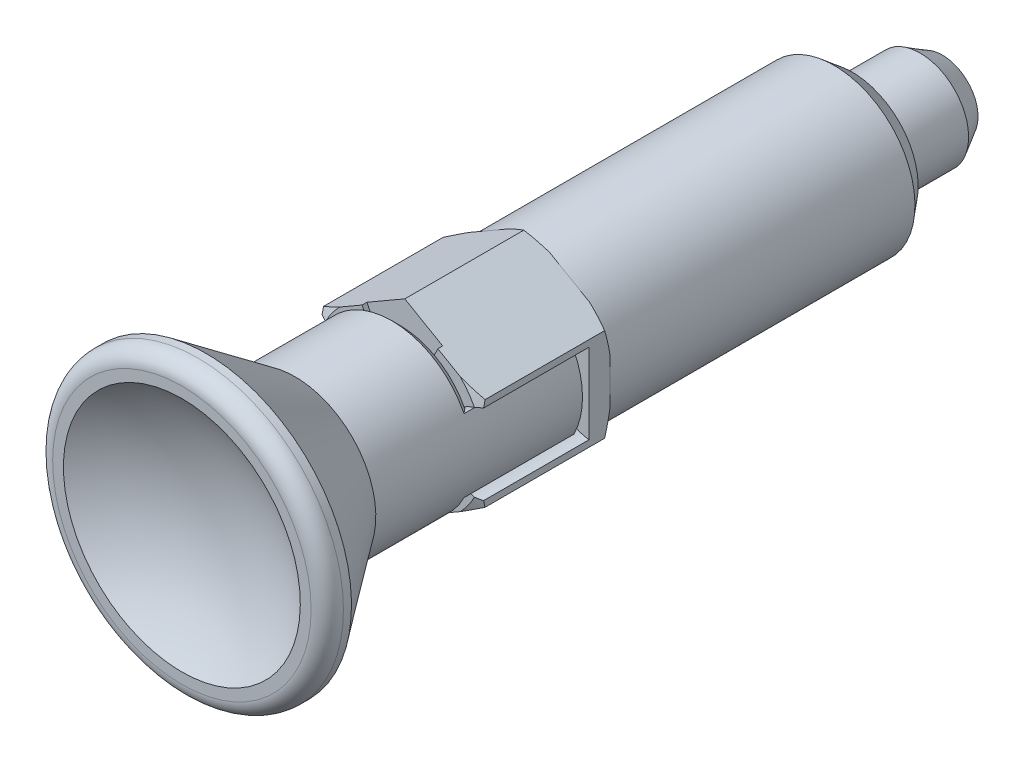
ISO-10303-21;
HEADER;
FILE_DESCRIPTION(('STEP AP214'),'2;1');
FILE_NAME('part.step','',(''),(''),'','','');
FILE_SCHEMA(('AUTOMOTIVE_DESIGN { 1 0 10303 214 1 1 1 1 }'));
ENDSEC;
DATA;
#1=APPLICATION_CONTEXT('core data for automotive mechanical design processes');
#2=APPLICATION_PROTOCOL_DEFINITION('international standard','automotive_design',2000,#1);
#3=PRODUCT_CONTEXT('',#1,'mechanical');
#4=PRODUCT('Part','Part','',(#3));
#5=PRODUCT_RELATED_PRODUCT_CATEGORY('part','',(#4));
#6=PRODUCT_DEFINITION_FORMATION('','',#4);
#7=PRODUCT_DEFINITION_CONTEXT('part definition',#1,'design');
#8=PRODUCT_DEFINITION('design','',#6,#7);
#9=PRODUCT_DEFINITION_SHAPE('','',#8);
#10=(LENGTH_UNIT() NAMED_UNIT(*) SI_UNIT(.MILLI.,.METRE.));
#11=(NAMED_UNIT(*) PLANE_ANGLE_UNIT() SI_UNIT($,.RADIAN.));
#12=(NAMED_UNIT(*) SI_UNIT($,.STERADIAN.) SOLID_ANGLE_UNIT());
#13=UNCERTAINTY_MEASURE_WITH_UNIT(LENGTH_MEASURE(1.E-05),#10,'distance_accuracy_value','');
#14=(GEOMETRIC_REPRESENTATION_CONTEXT(3) GLOBAL_UNCERTAINTY_ASSIGNED_CONTEXT((#13)) GLOBAL_UNIT_ASSIGNED_CONTEXT((#10,
#11,#12)) REPRESENTATION_CONTEXT('',''));
#15=CARTESIAN_POINT('',(0.,0.,0.));
#16=DIRECTION('',(0.,0.,1.));
#17=DIRECTION('',(1.,0.,0.));
#18=AXIS2_PLACEMENT_3D('',#15,#16,#17);
#19=CARTESIAN_POINT('',(0.,0.,0.333098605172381));
#20=DIRECTION('',(0.,0.,1.));
#21=DIRECTION('',(0.,-1.,0.));
#22=AXIS2_PLACEMENT_3D('',#19,#20,#21);
#23=CONICAL_SURFACE('',#22,5.77694370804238,1.04719755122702);
#24=CARTESIAN_POINT('',(3.73693168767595,3.61598417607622,4.67976352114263E-11));
#25=CARTESIAN_POINT('',(3.84366918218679,3.5543592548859,0.0195406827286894));
#26=CARTESIAN_POINT('',(3.95008007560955,3.49292289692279,0.041369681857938));
#27=CARTESIAN_POINT('',(4.16209708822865,3.3705148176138,0.0891744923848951));
#28=CARTESIAN_POINT('',(4.26770388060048,3.30954270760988,0.115146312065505));
#29=CARTESIAN_POINT('',(4.47815013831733,3.18804150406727,0.170841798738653));
#30=CARTESIAN_POINT('',(4.58298971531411,3.12751234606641,0.200564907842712));
#31=CARTESIAN_POINT('',(4.79201349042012,3.00683241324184,0.263399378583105));
#32=CARTESIAN_POINT('',(4.89619696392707,2.94668205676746,0.296513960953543));
#33=CARTESIAN_POINT('',(4.99999992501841,2.88675138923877,0.331111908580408));
#34=B_SPLINE_CURVE_WITH_KNOTS('',3,(#24,#25,#26,#27,#28,#29,#30,#31,#32,#33),.UNSPECIFIED.,.F.,
.F.,(4,2,2,2,4),(0.,0.374326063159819,0.748293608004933,1.12220560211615,1.49647603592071),.UNSPECIFIED.);
#35=CARTESIAN_POINT('',(3.73693168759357,3.61598417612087,3.34593464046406E-11));
#36=VERTEX_POINT('',#35);
#37=CARTESIAN_POINT('',(5.,2.88675136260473,0.331111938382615));
#38=VERTEX_POINT('',#37);
#39=EDGE_CURVE('E249',#36,#38,#34,.T.);
#40=ORIENTED_EDGE('',*,*,#39,.T.);
#41=CARTESIAN_POINT('',(4.99999996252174,2.88675137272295,0.331111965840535));
#42=CARTESIAN_POINT('',(4.99999998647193,2.76689003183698,0.296513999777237));
#43=CARTESIAN_POINT('',(4.9999999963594,2.64658931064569,0.263399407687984));
#44=CARTESIAN_POINT('',(5.00000000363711,2.40522942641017,0.200564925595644));
#45=CARTESIAN_POINT('',(5.00000000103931,2.28417110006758,0.170841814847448));
#46=CARTESIAN_POINT('',(4.99999999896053,2.04116867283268,0.115146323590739));
#47=CARTESIAN_POINT('',(4.99999999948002,1.91922444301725,0.0891745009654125));
#48=CARTESIAN_POINT('',(5.00000000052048,1.67440826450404,0.0413696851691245));
#49=CARTESIAN_POINT('',(5.00000000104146,1.55153553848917,0.0195406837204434));
#50=CARTESIAN_POINT('',(5.,1.42828568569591,4.82478640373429E-11));
#51=B_SPLINE_CURVE_WITH_KNOTS('',3,(#41,#42,#43,#44,#45,#46,#47,#48,#49,#50),.UNSPECIFIED.,.F.,
.F.,(4,2,2,2,4),(0.,0.374270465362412,0.748182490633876,1.12215006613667,1.49647616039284),.UNSPECIFIED.);
#52=CARTESIAN_POINT('',(5.,1.42828568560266,3.34610811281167E-11));
#53=VERTEX_POINT('',#52);
#54=EDGE_CURVE('E260',#38,#53,#51,.T.);
#55=ORIENTED_EDGE('',*,*,#54,.T.);
#56=CARTESIAN_POINT('',(0.,0.,1.86448079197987E-11));
#57=DIRECTION('',(0.,0.,1.));
#58=DIRECTION('',(0.,-1.,0.));
#59=AXIS2_PLACEMENT_3D('',#56,#57,#58);
#60=CIRCLE('',#59,5.19999999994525);
#61=EDGE_CURVE('E264',#36,#53,#60,.F.);
#62=ORIENTED_EDGE('',*,*,#61,.F.);
#63=EDGE_LOOP('',(#40,#55,#62));
#64=FACE_BOUND('',#63,.T.);
#65=ADVANCED_FACE('F14',(#64),#23,.T.);
#66=CARTESIAN_POINT('',(0.,0.,0.333098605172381));
#67=DIRECTION('',(0.,0.,1.));
#68=DIRECTION('',(0.,-1.,0.));
#69=AXIS2_PLACEMENT_3D('',#66,#67,#68);
#70=CONICAL_SURFACE('',#69,5.77694370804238,1.04719755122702);
#71=CARTESIAN_POINT('',(5.00000000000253,-1.42828568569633,4.67976352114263E-11));
#72=CARTESIAN_POINT('',(5.00000000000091,-1.55153552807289,0.0195406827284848));
#73=CARTESIAN_POINT('',(5.00000000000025,-1.67440824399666,0.0413696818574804));
#74=CARTESIAN_POINT('',(4.99999999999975,-1.91922440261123,0.0891744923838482));
#75=CARTESIAN_POINT('',(4.99999999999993,-2.04116862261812,0.115146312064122));
#76=CARTESIAN_POINT('',(5.00000000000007,-2.28417102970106,0.170841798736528));
#77=CARTESIAN_POINT('',(5.00000000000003,-2.40522934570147,0.200564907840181));
#78=CARTESIAN_POINT('',(4.99999999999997,-2.64658921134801,0.263399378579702));
#79=CARTESIAN_POINT('',(4.99999999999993,-2.76688992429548,0.296513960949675));
#80=CARTESIAN_POINT('',(5.,-2.88675125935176,0.331111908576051));
#81=B_SPLINE_CURVE_WITH_KNOTS('',3,(#71,#72,#73,#74,#75,#76,#77,#78,#79,#80),.UNSPECIFIED.,.F.,
.F.,(4,2,2,2,4),(0.,0.374326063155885,0.748293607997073,1.12220560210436,1.496476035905),.UNSPECIFIED.);
#82=CARTESIAN_POINT('',(5.,-1.42828568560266,3.34610811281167E-11));
#83=VERTEX_POINT('',#82);
#84=CARTESIAN_POINT('',(5.00000001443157,-2.88675133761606,0.331111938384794));
#85=VERTEX_POINT('',#84);
#86=EDGE_CURVE('E516',#83,#85,#81,.T.);
#87=ORIENTED_EDGE('',*,*,#86,.T.);
#88=CARTESIAN_POINT('',(5.00000000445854,-2.88675130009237,0.331111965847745));
#89=CARTESIAN_POINT('',(4.89619705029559,-2.94668199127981,0.296513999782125));
#90=CARTESIAN_POINT('',(4.79201357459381,-3.00683236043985,0.263399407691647));
#91=CARTESIAN_POINT('',(4.58298978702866,-3.12751230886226,0.200564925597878));
#92=CARTESIAN_POINT('',(4.47815019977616,-3.18804146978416,0.170841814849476));
#93=CARTESIAN_POINT('',(4.26770392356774,-3.30954268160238,0.115146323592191));
#94=CARTESIAN_POINT('',(4.16209712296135,-3.37051479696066,0.089174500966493));
#95=CARTESIAN_POINT('',(3.95008009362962,-3.49292288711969,0.0413696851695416));
#96=CARTESIAN_POINT('',(3.84366919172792,-3.554359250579,0.0195406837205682));
#97=CARTESIAN_POINT('',(3.73693168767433,-3.61598417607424,4.82478640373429E-11));
#98=B_SPLINE_CURVE_WITH_KNOTS('',3,(#88,#89,#90,#91,#92,#93,#94,#95,#96,#97),.UNSPECIFIED.,.F.,
.F.,(4,2,2,2,4),(0.,0.374270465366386,0.748182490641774,1.12215006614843,1.49647616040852),.UNSPECIFIED.);
#99=CARTESIAN_POINT('',(3.73693168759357,-3.61598417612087,3.34610811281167E-11));
#100=VERTEX_POINT('',#99);
#101=EDGE_CURVE('E507',#85,#100,#98,.T.);
#102=ORIENTED_EDGE('',*,*,#101,.T.);
#103=CARTESIAN_POINT('',(0.,0.,1.86448079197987E-11));
#104=DIRECTION('',(0.,0.,1.));
#105=DIRECTION('',(0.,-1.,0.));
#106=AXIS2_PLACEMENT_3D('',#103,#104,#105);
#107=CIRCLE('',#106,5.19999999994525);
#108=EDGE_CURVE('E990',#83,#100,#107,.F.);
#109=ORIENTED_EDGE('',*,*,#108,.F.);
#110=EDGE_LOOP('',(#87,#102,#109));
#111=FACE_BOUND('',#110,.T.);
#112=ADVANCED_FACE('F529',(#111),#70,.T.);
#113=CARTESIAN_POINT('',(0.,0.,0.333098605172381));
#114=DIRECTION('',(0.,0.,1.));
#115=DIRECTION('',(0.,-1.,0.));
#116=AXIS2_PLACEMENT_3D('',#113,#114,#115);
#117=CONICAL_SURFACE('',#116,5.77694370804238,1.04719755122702);
#118=CARTESIAN_POINT('',(-4.99999996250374,-2.8867513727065,0.331111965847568));
#119=CARTESIAN_POINT('',(-4.99999998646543,-2.76689003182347,0.29651399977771));
#120=CARTESIAN_POINT('',(-4.99999999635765,-2.646589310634,0.263399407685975));
#121=CARTESIAN_POINT('',(-5.00000000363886,-2.4052294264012,0.200564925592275));
#122=CARTESIAN_POINT('',(-5.00000000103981,-2.2841711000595,0.170841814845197));
#123=CARTESIAN_POINT('',(-4.99999999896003,-2.04116867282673,0.115146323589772));
#124=CARTESIAN_POINT('',(-4.99999999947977,-1.91922444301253,0.0891745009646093));
#125=CARTESIAN_POINT('',(-5.00000000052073,-1.67440826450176,0.0413696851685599));
#126=CARTESIAN_POINT('',(-5.00000000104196,-1.55153553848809,0.019540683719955));
#127=CARTESIAN_POINT('',(-5.,-1.42828568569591,4.82478640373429E-11));
#128=B_SPLINE_CURVE_WITH_KNOTS('',3,(#118,#119,#120,#121,#122,#123,#124,#125,#126,#127),
.UNSPECIFIED.,.F.,.F.,(4,2,2,2,4),(0.,0.374270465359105,0.748182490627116,1.12215006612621,
1.49647616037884),.UNSPECIFIED.);
#129=CARTESIAN_POINT('',(-5.,-2.88675136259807,0.331111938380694));
#130=VERTEX_POINT('',#129);
#131=CARTESIAN_POINT('',(-5.,-1.42828568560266,3.34593464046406E-11));
#132=VERTEX_POINT('',#131);
#133=EDGE_CURVE('E888',#130,#132,#128,.T.);
#134=ORIENTED_EDGE('',*,*,#133,.T.);
#135=CARTESIAN_POINT('',(0.,0.,1.86448079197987E-11));
#136=DIRECTION('',(0.,0.,1.));
#137=DIRECTION('',(0.,-1.,0.));
#138=AXIS2_PLACEMENT_3D('',#135,#136,#137);
#139=CIRCLE('',#138,5.19999999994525);
#140=CARTESIAN_POINT('',(-3.73693168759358,-3.61598417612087,3.34593464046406E-11));
#141=VERTEX_POINT('',#140);
#142=EDGE_CURVE('E988',#141,#132,#139,.F.);
#143=ORIENTED_EDGE('',*,*,#142,.F.);
#144=CARTESIAN_POINT('',(-3.73693168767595,-3.61598417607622,4.67976352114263E-11));
#145=CARTESIAN_POINT('',(-3.84366918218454,-3.5543592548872,0.0195406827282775));
#146=CARTESIAN_POINT('',(-3.95008007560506,-3.49292289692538,0.0413696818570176));
#147=CARTESIAN_POINT('',(-4.16209708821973,-3.37051481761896,0.0891744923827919));
#148=CARTESIAN_POINT('',(-4.26770388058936,-3.3095427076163,0.115146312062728));
#149=CARTESIAN_POINT('',(-4.47815013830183,-3.18804150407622,0.170841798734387));
#150=CARTESIAN_POINT('',(-4.58298971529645,-3.12751234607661,0.200564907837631));
#151=CARTESIAN_POINT('',(-4.79201349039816,-3.00683241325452,0.263399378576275));
#152=CARTESIAN_POINT('',(-4.89619696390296,-2.94668205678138,0.29651396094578));
#153=CARTESIAN_POINT('',(-4.99999992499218,-2.88675138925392,0.331111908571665));
#154=B_SPLINE_CURVE_WITH_KNOTS('',3,(#144,#145,#146,#147,#148,#149,#150,#151,#152,#153),
.UNSPECIFIED.,.F.,.F.,(4,2,2,2,4),(0.,0.374326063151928,0.748293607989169,1.12220560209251,
1.49647603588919),.UNSPECIFIED.);
#155=EDGE_CURVE('E515',#141,#130,#154,.T.);
#156=ORIENTED_EDGE('',*,*,#155,.T.);
#157=EDGE_LOOP('',(#134,#143,#156));
#158=FACE_BOUND('',#157,.T.);
#159=ADVANCED_FACE('F533',(#158),#117,.T.);
#160=CARTESIAN_POINT('',(0.,0.,0.333098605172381));
#161=DIRECTION('',(0.,0.,1.));
#162=DIRECTION('',(0.,-1.,0.));
#163=AXIS2_PLACEMENT_3D('',#160,#161,#162);
#164=CONICAL_SURFACE('',#163,5.77694370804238,1.04719755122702);
#165=CARTESIAN_POINT('',(-5.00000000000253,1.42828568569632,4.67993699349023E-11));
#166=CARTESIAN_POINT('',(-5.00000000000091,1.55153552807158,0.0195406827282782));
#167=CARTESIAN_POINT('',(-5.00000000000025,1.67440824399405,0.0413696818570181));
#168=CARTESIAN_POINT('',(-4.99999999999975,1.91922440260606,0.0891744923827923));
#169=CARTESIAN_POINT('',(-4.99999999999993,2.04116862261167,0.115146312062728));
#170=CARTESIAN_POINT('',(-5.00000000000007,2.28417102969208,0.170841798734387));
#171=CARTESIAN_POINT('',(-5.00000000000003,2.40522934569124,0.200564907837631));
#172=CARTESIAN_POINT('',(-4.99999999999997,2.64658921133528,0.263399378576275));
#173=CARTESIAN_POINT('',(-4.99999999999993,2.76688992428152,0.29651396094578));
#174=CARTESIAN_POINT('',(-5.,2.88675125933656,0.331111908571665));
#175=B_SPLINE_CURVE_WITH_KNOTS('',3,(#165,#166,#167,#168,#169,#170,#171,#172,#173,#174),
.UNSPECIFIED.,.F.,.F.,(4,2,2,2,4),(0.,0.374326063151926,0.748293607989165,1.12220560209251,
1.49647603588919),.UNSPECIFIED.);
#176=CARTESIAN_POINT('',(-5.,1.42828568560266,3.34610811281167E-11));
#177=VERTEX_POINT('',#176);
#178=CARTESIAN_POINT('',(-5.00000001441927,2.88675133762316,0.331111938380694));
#179=VERTEX_POINT('',#178);
#180=EDGE_CURVE('E880',#177,#179,#175,.T.);
#181=ORIENTED_EDGE('',*,*,#180,.T.);
#182=CARTESIAN_POINT('',(-5.0000000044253,2.88675130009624,0.331111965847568));
#183=CARTESIAN_POINT('',(-4.89619705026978,2.94668199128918,0.296513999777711));
#184=CARTESIAN_POINT('',(-4.79201357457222,3.00683236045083,0.263399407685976));
#185=CARTESIAN_POINT('',(-4.58298978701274,3.12751230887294,0.200564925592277));
#186=CARTESIAN_POINT('',(-4.47815019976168,3.18804146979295,0.170841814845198));
#187=CARTESIAN_POINT('',(-4.26770392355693,3.3095426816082,0.115146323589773));
#188=CARTESIAN_POINT('',(-4.16209712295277,3.3705147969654,0.0891745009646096));
#189=CARTESIAN_POINT('',(-3.9500800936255,3.49292288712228,0.0413696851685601));
#190=CARTESIAN_POINT('',(-3.84366919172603,3.55435925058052,0.0195406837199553));
#191=CARTESIAN_POINT('',(-3.73693168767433,3.61598417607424,4.82478640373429E-11));
#192=B_SPLINE_CURVE_WITH_KNOTS('',3,(#182,#183,#184,#185,#186,#187,#188,#189,#190,#191),
.UNSPECIFIED.,.F.,.F.,(4,2,2,2,4),(0.,0.374270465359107,0.748182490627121,1.12215006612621,
1.49647616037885),.UNSPECIFIED.);
#193=CARTESIAN_POINT('',(-3.73693168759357,3.61598417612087,3.34610811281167E-11));
#194=VERTEX_POINT('',#193);
#195=EDGE_CURVE('E887',#179,#194,#192,.T.);
#196=ORIENTED_EDGE('',*,*,#195,.T.);
#197=CARTESIAN_POINT('',(0.,0.,1.86448079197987E-11));
#198=DIRECTION('',(0.,0.,1.));
#199=DIRECTION('',(0.,-1.,0.));
#200=AXIS2_PLACEMENT_3D('',#197,#198,#199);
#201=CIRCLE('',#200,5.19999999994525);
#202=EDGE_CURVE('E978',#177,#194,#201,.F.);
#203=ORIENTED_EDGE('',*,*,#202,.F.);
#204=EDGE_LOOP('',(#181,#196,#203));
#205=FACE_BOUND('',#204,.T.);
#206=ADVANCED_FACE('F898',(#205),#164,.T.);
#207=CARTESIAN_POINT('',(0.,0.,0.333098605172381));
#208=DIRECTION('',(0.,0.,1.));
#209=DIRECTION('',(0.,-1.,0.));
#210=AXIS2_PLACEMENT_3D('',#207,#208,#209);
#211=CONICAL_SURFACE('',#210,5.77694370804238,1.04719755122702);
#212=CARTESIAN_POINT('',(-1.26306831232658,5.04426986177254,4.67993699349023E-11));
#213=CARTESIAN_POINT('',(-1.15633081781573,5.10589478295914,0.0195406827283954));
#214=CARTESIAN_POINT('',(-1.04991992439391,5.16733114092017,0.0413696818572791));
#215=CARTESIAN_POINT('',(-0.837902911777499,5.28973922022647,0.0891744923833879));
#216=CARTESIAN_POINT('',(-0.732296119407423,5.35071133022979,0.115146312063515));
#217=CARTESIAN_POINT('',(-0.521849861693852,5.47221253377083,0.170841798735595));
#218=CARTESIAN_POINT('',(-0.417010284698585,5.53274169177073,0.20056490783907));
#219=CARTESIAN_POINT('',(-0.207986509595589,5.6534216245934,0.263399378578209));
#220=CARTESIAN_POINT('',(-0.103803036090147,5.71357198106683,0.296513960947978));
#221=CARTESIAN_POINT('',(-7.50003948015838E-08,5.77350264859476,0.33111190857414));
#222=B_SPLINE_CURVE_WITH_KNOTS('',3,(#212,#213,#214,#215,#216,#217,#218,#219,#220,#221),
.UNSPECIFIED.,.F.,.F.,(4,2,2,2,4),(0.,0.374326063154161,0.748293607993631,1.1222056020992,
1.49647603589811),.UNSPECIFIED.);
#223=CARTESIAN_POINT('',(-1.26306831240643,5.04426986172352,3.34610811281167E-11));
#224=VERTEX_POINT('',#223);
#225=CARTESIAN_POINT('',(-1.44155947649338E-08,5.77350270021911,0.331111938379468));
#226=VERTEX_POINT('',#225);
#227=EDGE_CURVE('E277',#224,#226,#222,.T.);
#228=ORIENTED_EDGE('',*,*,#227,.T.);
#229=CARTESIAN_POINT('',(-4.19132781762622E-08,5.77350267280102,0.331111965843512));
#230=CARTESIAN_POINT('',(0.103802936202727,5.71357202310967,0.296513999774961));
#231=CARTESIAN_POINT('',(0.207986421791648,5.65342167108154,0.263399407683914));
#232=CARTESIAN_POINT('',(0.417010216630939,5.53274173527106,0.200564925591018));
#233=CARTESIAN_POINT('',(0.521849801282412,5.47221256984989,0.170841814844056));
#234=CARTESIAN_POINT('',(0.732296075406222,5.3507113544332,0.115146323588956));
#235=CARTESIAN_POINT('',(0.837902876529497,5.28973923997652,0.0891745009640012));
#236=CARTESIAN_POINT('',(1.04991990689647,5.16733115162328,0.0413696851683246));
#237=CARTESIAN_POINT('',(1.15633080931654,5.10589478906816,0.0195406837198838));
#238=CARTESIAN_POINT('',(1.26306831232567,5.04426986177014,4.8246129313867E-11));
#239=B_SPLINE_CURVE_WITH_KNOTS('',3,(#229,#230,#231,#232,#233,#234,#235,#236,#237,#238),
.UNSPECIFIED.,.F.,.F.,(4,2,2,2,4),(0.,0.374270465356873,0.748182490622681,1.1221500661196,
1.49647616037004),.UNSPECIFIED.);
#240=CARTESIAN_POINT('',(1.26306831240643,5.04426986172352,3.34593464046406E-11));
#241=VERTEX_POINT('',#240);
#242=EDGE_CURVE('E275',#226,#241,#239,.T.);
#243=ORIENTED_EDGE('',*,*,#242,.T.);
#244=CARTESIAN_POINT('',(0.,0.,1.86448079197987E-11));
#245=DIRECTION('',(0.,0.,1.));
#246=DIRECTION('',(0.,-1.,0.));
#247=AXIS2_PLACEMENT_3D('',#244,#245,#246);
#248=CIRCLE('',#247,5.19999999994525);
#249=EDGE_CURVE('E971',#224,#241,#248,.F.);
#250=ORIENTED_EDGE('',*,*,#249,.F.);
#251=EDGE_LOOP('',(#228,#243,#250));
#252=FACE_BOUND('',#251,.T.);
#253=ADVANCED_FACE('F902',(#252),#211,.T.);
#254=CARTESIAN_POINT('',(5.,0.,0.));
#255=DIRECTION('',(0.,0.,-1.));
#256=DIRECTION('',(0.,1.,0.));
#257=AXIS2_PLACEMENT_3D('',#254,#255,#256);
#258=PLANE('',#257);
#259=ORIENTED_EDGE('',*,*,#61,.T.);
#260=DIRECTION('',(0.,1.,0.));
#261=VECTOR('',#260,1.);
#262=CARTESIAN_POINT('',(5.,0.,0.));
#263=LINE('',#262,#261);
#264=CARTESIAN_POINT('',(5.,0.,0.));
#265=VERTEX_POINT('',#264);
#266=EDGE_CURVE('E269',#53,#265,#263,.F.);
#267=ORIENTED_EDGE('',*,*,#266,.T.);
#268=CARTESIAN_POINT('',(0.,0.,0.));
#269=DIRECTION('',(0.,0.,1.));
#270=DIRECTION('',(0.,-1.,0.));
#271=AXIS2_PLACEMENT_3D('',#268,#269,#270);
#272=CIRCLE('',#271,5.);
#273=CARTESIAN_POINT('',(2.5,4.3301270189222,0.));
#274=VERTEX_POINT('',#273);
#275=EDGE_CURVE('E273',#274,#265,#272,.F.);
#276=ORIENTED_EDGE('',*,*,#275,.F.);
#277=DIRECTION('',(0.866025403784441,-0.5,0.));
#278=VECTOR('',#277,1.);
#279=CARTESIAN_POINT('',(2.5,4.33012701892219,0.));
#280=LINE('',#279,#278);
#281=EDGE_CURVE('E255',#274,#36,#280,.T.);
#282=ORIENTED_EDGE('',*,*,#281,.T.);
#283=EDGE_LOOP('',(#259,#267,#276,#282));
#284=FACE_BOUND('',#283,.T.);
#285=ADVANCED_FACE('F271',(#284),#258,.T.);
#286=CARTESIAN_POINT('',(5.,0.,0.));
#287=DIRECTION('',(0.,0.,-1.));
#288=DIRECTION('',(0.,1.,0.));
#289=AXIS2_PLACEMENT_3D('',#286,#287,#288);
#290=PLANE('',#289);
#291=ORIENTED_EDGE('',*,*,#108,.T.);
#292=DIRECTION('',(-0.866025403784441,-0.5,0.));
#293=VECTOR('',#292,1.);
#294=CARTESIAN_POINT('',(3.7369316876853,-3.61598417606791,0.));
#295=LINE('',#294,#293);
#296=CARTESIAN_POINT('',(2.5,-4.3301270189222,0.));
#297=VERTEX_POINT('',#296);
#298=EDGE_CURVE('E989',#100,#297,#295,.T.);
#299=ORIENTED_EDGE('',*,*,#298,.T.);
#300=CARTESIAN_POINT('',(0.,0.,0.));
#301=DIRECTION('',(0.,0.,1.));
#302=DIRECTION('',(0.,-1.,0.));
#303=AXIS2_PLACEMENT_3D('',#300,#301,#302);
#304=CIRCLE('',#303,5.);
#305=EDGE_CURVE('E998',#265,#297,#304,.F.);
#306=ORIENTED_EDGE('',*,*,#305,.F.);
#307=DIRECTION('',(0.,1.,0.));
#308=VECTOR('',#307,1.);
#309=CARTESIAN_POINT('',(5.,0.,0.));
#310=LINE('',#309,#308);
#311=EDGE_CURVE('E991',#265,#83,#310,.F.);
#312=ORIENTED_EDGE('',*,*,#311,.T.);
#313=EDGE_LOOP('',(#291,#299,#306,#312));
#314=FACE_BOUND('',#313,.T.);
#315=ADVANCED_FACE('F999',(#314),#290,.T.);
#316=CARTESIAN_POINT('',(5.,0.,0.));
#317=DIRECTION('',(0.,0.,-1.));
#318=DIRECTION('',(0.,1.,0.));
#319=AXIS2_PLACEMENT_3D('',#316,#317,#318);
#320=PLANE('',#319);
#321=CARTESIAN_POINT('',(0.,0.,0.));
#322=DIRECTION('',(0.,0.,1.));
#323=DIRECTION('',(0.,-1.,0.));
#324=AXIS2_PLACEMENT_3D('',#321,#322,#323);
#325=CIRCLE('',#324,5.);
#326=CARTESIAN_POINT('',(-2.5,-4.33012701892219,0.));
#327=VERTEX_POINT('',#326);
#328=CARTESIAN_POINT('',(-5.,0.,0.));
#329=VERTEX_POINT('',#328);
#330=EDGE_CURVE('E1003',#327,#329,#325,.F.);
#331=ORIENTED_EDGE('',*,*,#330,.F.);
#332=DIRECTION('',(-0.866025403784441,0.5,0.));
#333=VECTOR('',#332,1.);
#334=CARTESIAN_POINT('',(-2.5,-4.33012701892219,0.));
#335=LINE('',#334,#333);
#336=EDGE_CURVE('E982',#327,#141,#335,.T.);
#337=ORIENTED_EDGE('',*,*,#336,.T.);
#338=ORIENTED_EDGE('',*,*,#142,.T.);
#339=DIRECTION('',(0.,1.,0.));
#340=VECTOR('',#339,1.);
#341=CARTESIAN_POINT('',(-5.,0.,0.));
#342=LINE('',#341,#340);
#343=EDGE_CURVE('E985',#132,#329,#342,.T.);
#344=ORIENTED_EDGE('',*,*,#343,.T.);
#345=EDGE_LOOP('',(#331,#337,#338,#344));
#346=FACE_BOUND('',#345,.T.);
#347=ADVANCED_FACE('F1022',(#346),#320,.T.);
#348=CARTESIAN_POINT('',(5.,0.,0.));
#349=DIRECTION('',(0.,0.,-1.));
#350=DIRECTION('',(0.,1.,0.));
#351=AXIS2_PLACEMENT_3D('',#348,#349,#350);
#352=PLANE('',#351);
#353=ORIENTED_EDGE('',*,*,#202,.T.);
#354=DIRECTION('',(0.866025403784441,0.5,0.));
#355=VECTOR('',#354,1.);
#356=CARTESIAN_POINT('',(-3.7369316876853,3.61598417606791,0.));
#357=LINE('',#356,#355);
#358=CARTESIAN_POINT('',(-2.5,4.33012701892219,0.));
#359=VERTEX_POINT('',#358);
#360=EDGE_CURVE('E975',#194,#359,#357,.T.);
#361=ORIENTED_EDGE('',*,*,#360,.T.);
#362=CARTESIAN_POINT('',(0.,0.,0.));
#363=DIRECTION('',(0.,0.,1.));
#364=DIRECTION('',(0.,-1.,0.));
#365=AXIS2_PLACEMENT_3D('',#362,#363,#364);
#366=CIRCLE('',#365,5.);
#367=EDGE_CURVE('E1031',#329,#359,#366,.F.);
#368=ORIENTED_EDGE('',*,*,#367,.F.);
#369=DIRECTION('',(0.,1.,0.));
#370=VECTOR('',#369,1.);
#371=CARTESIAN_POINT('',(-5.,0.,0.));
#372=LINE('',#371,#370);
#373=EDGE_CURVE('E979',#329,#177,#372,.T.);
#374=ORIENTED_EDGE('',*,*,#373,.T.);
#375=EDGE_LOOP('',(#353,#361,#368,#374));
#376=FACE_BOUND('',#375,.T.);
#377=ADVANCED_FACE('F1030',(#376),#352,.T.);
#378=CARTESIAN_POINT('',(5.,0.,0.));
#379=DIRECTION('',(0.,0.,-1.));
#380=DIRECTION('',(0.,1.,0.));
#381=AXIS2_PLACEMENT_3D('',#378,#379,#380);
#382=PLANE('',#381);
#383=ORIENTED_EDGE('',*,*,#249,.T.);
#384=DIRECTION('',(0.866025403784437,-0.5,0.));
#385=VECTOR('',#384,1.);
#386=CARTESIAN_POINT('',(1.2630683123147,5.04426986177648,0.));
#387=LINE('',#386,#385);
#388=EDGE_CURVE('E969',#241,#274,#387,.T.);
#389=ORIENTED_EDGE('',*,*,#388,.T.);
#390=CARTESIAN_POINT('',(0.,0.,0.));
#391=DIRECTION('',(0.,0.,1.));
#392=DIRECTION('',(0.,-1.,0.));
#393=AXIS2_PLACEMENT_3D('',#390,#391,#392);
#394=CIRCLE('',#393,5.);
#395=EDGE_CURVE('E1010',#359,#274,#394,.F.);
#396=ORIENTED_EDGE('',*,*,#395,.F.);
#397=DIRECTION('',(0.866025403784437,0.5,0.));
#398=VECTOR('',#397,1.);
#399=CARTESIAN_POINT('',(-2.5,4.33012701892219,0.));
#400=LINE('',#399,#398);
#401=EDGE_CURVE('E972',#359,#224,#400,.T.);
#402=ORIENTED_EDGE('',*,*,#401,.T.);
#403=EDGE_LOOP('',(#383,#389,#396,#402));
#404=FACE_BOUND('',#403,.T.);
#405=ADVANCED_FACE('F1213',(#404),#382,.T.);
#406=CARTESIAN_POINT('',(0.,0.,-20.));
#407=DIRECTION('',(0.,0.,1.));
#408=DIRECTION('',(0.,-1.,0.));
#409=AXIS2_PLACEMENT_3D('',#406,#407,#408);
#410=CYLINDRICAL_SURFACE('',#409,5.);
#411=ORIENTED_EDGE('',*,*,#367,.T.);
#412=ORIENTED_EDGE('',*,*,#395,.T.);
#413=ORIENTED_EDGE('',*,*,#275,.T.);
#414=ORIENTED_EDGE('',*,*,#305,.T.);
#415=CARTESIAN_POINT('',(0.,0.,0.));
#416=DIRECTION('',(0.,0.,1.));
#417=DIRECTION('',(0.,-1.,0.));
#418=AXIS2_PLACEMENT_3D('',#415,#416,#417);
#419=CIRCLE('',#418,5.);
#420=EDGE_CURVE('E968',#327,#297,#419,.T.);
#421=ORIENTED_EDGE('',*,*,#420,.F.);
#422=ORIENTED_EDGE('',*,*,#330,.T.);
#423=EDGE_LOOP('',(#411,#412,#413,#414,#421,#422));
#424=FACE_BOUND('',#423,.T.);
#425=CARTESIAN_POINT('',(0.,0.,-18.88));
#426=DIRECTION('',(0.,0.,1.));
#427=DIRECTION('',(0.,-1.,0.));
#428=AXIS2_PLACEMENT_3D('',#425,#426,#427);
#429=CIRCLE('',#428,5.);
#430=CARTESIAN_POINT('',(0.,-5.,-18.88));
#431=VERTEX_POINT('',#430);
#432=EDGE_CURVE('E261',#431,#431,#429,.T.);
#433=ORIENTED_EDGE('',*,*,#432,.T.);
#434=EDGE_LOOP('',(#433));
#435=FACE_BOUND('',#434,.T.);
#436=ADVANCED_FACE('F1007',(#424,#435),#410,.T.);
#437=CARTESIAN_POINT('',(5.,0.,0.));
#438=DIRECTION('',(0.,0.,-1.));
#439=DIRECTION('',(0.,1.,0.));
#440=AXIS2_PLACEMENT_3D('',#437,#438,#439);
#441=PLANE('',#440);
#442=CARTESIAN_POINT('',(0.,0.,1.86448079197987E-11));
#443=DIRECTION('',(0.,0.,1.));
#444=DIRECTION('',(0.,-1.,0.));
#445=AXIS2_PLACEMENT_3D('',#442,#443,#444);
#446=CIRCLE('',#445,5.19999999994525);
#447=CARTESIAN_POINT('',(-1.26306831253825,-5.04426986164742,9.32240395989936E-12));
#448=VERTEX_POINT('',#447);
#449=CARTESIAN_POINT('',(1.26306831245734,-5.04426986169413,2.41386771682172E-11));
#450=VERTEX_POINT('',#449);
#451=EDGE_CURVE('E965',#448,#450,#446,.T.);
#452=ORIENTED_EDGE('',*,*,#451,.F.);
#453=DIRECTION('',(-0.866025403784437,0.5,0.));
#454=VECTOR('',#453,1.);
#455=CARTESIAN_POINT('',(-1.2630683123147,-5.04426986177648,0.));
#456=LINE('',#455,#454);
#457=EDGE_CURVE('E962',#448,#327,#456,.T.);
#458=ORIENTED_EDGE('',*,*,#457,.T.);
#459=ORIENTED_EDGE('',*,*,#420,.T.);
#460=DIRECTION('',(-0.866025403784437,-0.5,0.));
#461=VECTOR('',#460,1.);
#462=CARTESIAN_POINT('',(2.5,-4.33012701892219,0.));
#463=LINE('',#462,#461);
#464=EDGE_CURVE('E966',#297,#450,#463,.T.);
#465=ORIENTED_EDGE('',*,*,#464,.T.);
#466=EDGE_LOOP('',(#452,#458,#459,#465));
#467=FACE_BOUND('',#466,.T.);
#468=ADVANCED_FACE('F1177',(#467),#441,.T.);
#469=CARTESIAN_POINT('',(0.,0.,0.333098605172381));
#470=DIRECTION('',(0.,0.,1.));
#471=DIRECTION('',(0.,-1.,0.));
#472=AXIS2_PLACEMENT_3D('',#469,#470,#471);
#473=CONICAL_SURFACE('',#472,5.77694370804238,1.04719755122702);
#474=CARTESIAN_POINT('',(1.26306831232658,-5.04426986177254,4.67976352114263E-11));
#475=CARTESIAN_POINT('',(1.15633081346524,-5.1058947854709,0.0195406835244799));
#476=CARTESIAN_POINT('',(1.04991991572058,-5.16733114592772,0.0413696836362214));
#477=CARTESIAN_POINT('',(0.837902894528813,-5.289739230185,0.0891744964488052));
#478=CARTESIAN_POINT('',(0.732296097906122,-5.35071134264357,0.115146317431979));
#479=CARTESIAN_POINT('',(0.521849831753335,-5.47221255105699,0.17084180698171));
#480=CARTESIAN_POINT('',(0.417010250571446,-5.53274171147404,0.200564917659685));
#481=CARTESIAN_POINT('',(0.207986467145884,-5.65342164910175,0.263399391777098));
#482=CARTESIAN_POINT('',(0.103802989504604,-5.71357200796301,0.296513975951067));
#483=CARTESIAN_POINT('',(2.43085439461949E-08,-5.77350267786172,0.331111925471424));
#484=B_SPLINE_CURVE_WITH_KNOTS('',3,(#474,#475,#476,#477,#478,#479,#480,#481,#482,#483),
.UNSPECIFIED.,.F.,.F.,(4,2,2,2,4),(0.,0.374326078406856,0.748293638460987,1.12220564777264,
1.49647609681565),.UNSPECIFIED.);
#485=CARTESIAN_POINT('',(0.,-5.77350267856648,0.331111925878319));
#486=VERTEX_POINT('',#485);
#487=EDGE_CURVE('E499',#450,#486,#484,.T.);
#488=ORIENTED_EDGE('',*,*,#487,.T.);
#489=CARTESIAN_POINT('',(-1.26306831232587,-5.04426986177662,4.53161813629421E-11));
#490=CARTESIAN_POINT('',(-1.15633081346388,-5.10589478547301,0.019540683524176));
#491=CARTESIAN_POINT('',(-1.04991991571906,-5.16733114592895,0.0413696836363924));
#492=CARTESIAN_POINT('',(-0.837902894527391,-5.28973923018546,0.0891744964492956));
#493=CARTESIAN_POINT('',(-0.732296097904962,-5.35071134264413,0.115146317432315));
#494=CARTESIAN_POINT('',(-0.521849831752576,-5.47221255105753,0.170841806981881));
#495=CARTESIAN_POINT('',(-0.417010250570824,-5.53274171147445,0.200564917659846));
#496=CARTESIAN_POINT('',(-0.207986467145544,-5.65342164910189,0.263399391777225));
#497=CARTESIAN_POINT('',(-0.103802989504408,-5.71357200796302,0.296513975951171));
#498=CARTESIAN_POINT('',(-2.43085429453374E-08,-5.77350267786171,0.331111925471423));
#499=B_SPLINE_CURVE_WITH_KNOTS('',3,(#489,#490,#491,#492,#493,#494,#495,#496,#497,#498),
.UNSPECIFIED.,.F.,.F.,(4,2,2,2,4),(0.,0.374326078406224,0.748293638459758,1.12220564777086,
1.49647609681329),.UNSPECIFIED.);
#500=EDGE_CURVE('E479',#448,#486,#499,.T.);
#501=ORIENTED_EDGE('',*,*,#500,.F.);
#502=ORIENTED_EDGE('',*,*,#451,.T.);
#503=EDGE_LOOP('',(#488,#501,#502));
#504=FACE_BOUND('',#503,.T.);
#505=ADVANCED_FACE('F923',(#504),#473,.T.);
#506=CARTESIAN_POINT('',(0.,5.77350269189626,0.));
#507=DIRECTION('',(-0.5,0.866025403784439,0.));
#508=DIRECTION('',(-0.866025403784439,-0.5,0.));
#509=AXIS2_PLACEMENT_3D('',#506,#507,#508);
#510=PLANE('',#509);
#511=CARTESIAN_POINT('',(-5.,2.88675134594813,7.73257130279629));
#512=CARTESIAN_POINT('',(-4.8957144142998,2.94696065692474,7.76064568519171));
#513=CARTESIAN_POINT('',(-4.7911713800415,3.00731860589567,7.78747519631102));
#514=CARTESIAN_POINT('',(-4.58164596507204,3.12828816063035,7.83832603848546));
#515=CARTESIAN_POINT('',(-4.47666391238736,3.18889957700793,7.86234917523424));
#516=CARTESIAN_POINT('',(-4.26619072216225,3.3104163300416,7.90730814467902));
#517=CARTESIAN_POINT('',(-4.16069953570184,3.37132169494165,7.92824367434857));
#518=CARTESIAN_POINT('',(-3.94918713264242,3.49343843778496,7.96673685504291));
#519=CARTESIAN_POINT('',(-3.84316561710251,3.55464998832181,7.98429231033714));
#520=CARTESIAN_POINT('',(-3.73693168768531,3.61598417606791,8.));
#521=B_SPLINE_CURVE_WITH_KNOTS('',3,(#511,#512,#513,#514,#515,#516,#517,#518,#519,#520),
.UNSPECIFIED.,.F.,.F.,(4,2,2,2,4),(0.,0.370947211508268,0.741654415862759,1.11239797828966,
1.48338157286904),.UNSPECIFIED.);
#522=CARTESIAN_POINT('',(-5.,2.88675134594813,7.73257130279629));
#523=VERTEX_POINT('',#522);
#524=CARTESIAN_POINT('',(-3.73693168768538,3.61598417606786,8.));
#525=VERTEX_POINT('',#524);
#526=EDGE_CURVE('E929',#523,#525,#521,.T.);
#527=ORIENTED_EDGE('',*,*,#526,.T.);
#528=DIRECTION('',(-0.866025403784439,-0.5,0.));
#529=VECTOR('',#528,1.);
#530=CARTESIAN_POINT('',(0.,5.77350269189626,8.));
#531=LINE('',#530,#529);
#532=CARTESIAN_POINT('',(-2.34077255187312,4.42205702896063,8.));
#533=VERTEX_POINT('',#532);
#534=EDGE_CURVE('E851',#525,#533,#531,.F.);
#535=ORIENTED_EDGE('',*,*,#534,.T.);
#536=DIRECTION('',(0.,0.,1.));
#537=VECTOR('',#536,1.);
#538=CARTESIAN_POINT('',(-2.34077255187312,4.42205702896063,0.));
#539=LINE('',#538,#537);
#540=CARTESIAN_POINT('',(-2.34077255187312,4.42205702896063,7.7));
#541=VERTEX_POINT('',#540);
#542=EDGE_CURVE('E935',#533,#541,#539,.F.);
#543=ORIENTED_EDGE('',*,*,#542,.T.);
#544=DIRECTION('',(-0.866025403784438,-0.5,0.));
#545=VECTOR('',#544,1.);
#546=CARTESIAN_POINT('',(0.,5.77350269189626,7.7));
#547=LINE('',#546,#545);
#548=CARTESIAN_POINT('',(0.,5.77350269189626,7.7));
#549=VERTEX_POINT('',#548);
#550=EDGE_CURVE('E769',#549,#541,#547,.T.);
#551=ORIENTED_EDGE('',*,*,#550,.F.);
#552=DIRECTION('',(0.,0.,1.));
#553=VECTOR('',#552,1.);
#554=CARTESIAN_POINT('',(0.,5.77350269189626,0.));
#555=LINE('',#554,#553);
#556=EDGE_CURVE('E780',#226,#549,#555,.T.);
#557=ORIENTED_EDGE('',*,*,#556,.F.);
#558=ORIENTED_EDGE('',*,*,#227,.F.);
#559=ORIENTED_EDGE('',*,*,#401,.F.);
#560=ORIENTED_EDGE('',*,*,#360,.F.);
#561=ORIENTED_EDGE('',*,*,#195,.F.);
#562=DIRECTION('',(0.,0.,1.));
#563=VECTOR('',#562,1.);
#564=CARTESIAN_POINT('',(-5.,2.88675134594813,0.));
#565=LINE('',#564,#563);
#566=EDGE_CURVE('E1434',#523,#179,#565,.F.);
#567=ORIENTED_EDGE('',*,*,#566,.F.);
#568=EDGE_LOOP('',(#527,#535,#543,#551,#557,#558,#559,#560,#561,#567));
#569=FACE_BOUND('',#568,.T.);
#570=ADVANCED_FACE('F920',(#569),#510,.T.);
#571=CARTESIAN_POINT('',(-5.,-2.88675134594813,0.));
#572=DIRECTION('',(-0.5,-0.866025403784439,0.));
#573=DIRECTION('',(0.866025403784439,-0.5,0.));
#574=AXIS2_PLACEMENT_3D('',#571,#572,#573);
#575=PLANE('',#574);
#576=DIRECTION('',(0.,0.,1.));
#577=VECTOR('',#576,1.);
#578=CARTESIAN_POINT('',(0.,-5.77350269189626,0.));
#579=LINE('',#578,#577);
#580=CARTESIAN_POINT('',(0.,-5.77350269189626,7.7));
#581=VERTEX_POINT('',#580);
#582=EDGE_CURVE('E470',#581,#486,#579,.F.);
#583=ORIENTED_EDGE('',*,*,#582,.F.);
#584=DIRECTION('',(0.866025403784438,-0.5,0.));
#585=VECTOR('',#584,1.);
#586=CARTESIAN_POINT('',(-2.34077255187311,-4.42205702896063,7.7));
#587=LINE('',#586,#585);
#588=CARTESIAN_POINT('',(-2.34077255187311,-4.42205702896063,7.7));
#589=VERTEX_POINT('',#588);
#590=EDGE_CURVE('E842',#589,#581,#587,.T.);
#591=ORIENTED_EDGE('',*,*,#590,.F.);
#592=DIRECTION('',(0.,0.,1.));
#593=VECTOR('',#592,1.);
#594=CARTESIAN_POINT('',(-2.34077255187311,-4.42205702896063,0.));
#595=LINE('',#594,#593);
#596=CARTESIAN_POINT('',(-2.34077255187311,-4.42205702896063,8.));
#597=VERTEX_POINT('',#596);
#598=EDGE_CURVE('E847',#589,#597,#595,.T.);
#599=ORIENTED_EDGE('',*,*,#598,.T.);
#600=DIRECTION('',(0.866025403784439,-0.5,0.));
#601=VECTOR('',#600,1.);
#602=CARTESIAN_POINT('',(-5.,-2.88675134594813,8.));
#603=LINE('',#602,#601);
#604=CARTESIAN_POINT('',(-3.73693168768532,-3.6159841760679,8.));
#605=VERTEX_POINT('',#604);
#606=EDGE_CURVE('E850',#597,#605,#603,.F.);
#607=ORIENTED_EDGE('',*,*,#606,.T.);
#608=CARTESIAN_POINT('',(-3.7369316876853,-3.6159841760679,8.));
#609=CARTESIAN_POINT('',(-3.84316561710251,-3.55464998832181,7.98429231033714));
#610=CARTESIAN_POINT('',(-3.94918713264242,-3.49343843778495,7.96673685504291));
#611=CARTESIAN_POINT('',(-4.16069953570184,-3.37132169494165,7.92824367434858));
#612=CARTESIAN_POINT('',(-4.26619072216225,-3.3104163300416,7.90730814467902));
#613=CARTESIAN_POINT('',(-4.47666391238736,-3.18889957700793,7.86234917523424));
#614=CARTESIAN_POINT('',(-4.58164596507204,-3.12828816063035,7.83832603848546));
#615=CARTESIAN_POINT('',(-4.7911713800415,-3.00731860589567,7.78747519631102));
#616=CARTESIAN_POINT('',(-4.8957144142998,-2.94696065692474,7.76064568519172));
#617=CARTESIAN_POINT('',(-5.,-2.88675134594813,7.7325713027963));
#618=B_SPLINE_CURVE_WITH_KNOTS('',3,(#608,#609,#610,#611,#612,#613,#614,#615,#616,#617),
.UNSPECIFIED.,.F.,.F.,(4,2,2,2,4),(0.,0.37098359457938,0.741727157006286,1.11243436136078,
1.48338157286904),.UNSPECIFIED.);
#619=CARTESIAN_POINT('',(-5.,-2.88675134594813,7.73257130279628));
#620=VERTEX_POINT('',#619);
#621=EDGE_CURVE('E936',#605,#620,#618,.T.);
#622=ORIENTED_EDGE('',*,*,#621,.T.);
#623=DIRECTION('',(0.,0.,1.));
#624=VECTOR('',#623,1.);
#625=CARTESIAN_POINT('',(-5.,-2.88675134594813,0.));
#626=LINE('',#625,#624);
#627=EDGE_CURVE('E857',#130,#620,#626,.T.);
#628=ORIENTED_EDGE('',*,*,#627,.F.);
#629=ORIENTED_EDGE('',*,*,#155,.F.);
#630=ORIENTED_EDGE('',*,*,#336,.F.);
#631=ORIENTED_EDGE('',*,*,#457,.F.);
#632=ORIENTED_EDGE('',*,*,#500,.T.);
#633=EDGE_LOOP('',(#583,#591,#599,#607,#622,#628,#629,#630,#631,#632));
#634=FACE_BOUND('',#633,.T.);
#635=ADVANCED_FACE('F490',(#634),#575,.T.);
#636=CARTESIAN_POINT('',(0.,-5.77350269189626,0.));
#637=DIRECTION('',(0.5,-0.866025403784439,0.));
#638=DIRECTION('',(0.866025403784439,0.5,0.));
#639=AXIS2_PLACEMENT_3D('',#636,#637,#638);
#640=PLANE('',#639);
#641=CARTESIAN_POINT('',(5.,-2.88675134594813,7.73257130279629));
#642=CARTESIAN_POINT('',(4.8957144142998,-2.94696065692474,7.76064568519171));
#643=CARTESIAN_POINT('',(4.7911713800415,-3.00731860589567,7.78747519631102));
#644=CARTESIAN_POINT('',(4.58164596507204,-3.12828816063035,7.83832603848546));
#645=CARTESIAN_POINT('',(4.47666391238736,-3.18889957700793,7.86234917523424));
#646=CARTESIAN_POINT('',(4.26619072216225,-3.3104163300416,7.90730814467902));
#647=CARTESIAN_POINT('',(4.16069953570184,-3.37132169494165,7.92824367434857));
#648=CARTESIAN_POINT('',(3.94918713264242,-3.49343843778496,7.96673685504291));
#649=CARTESIAN_POINT('',(3.84316561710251,-3.55464998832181,7.98429231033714));
#650=CARTESIAN_POINT('',(3.73693168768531,-3.61598417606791,8.));
#651=B_SPLINE_CURVE_WITH_KNOTS('',3,(#641,#642,#643,#644,#645,#646,#647,#648,#649,#650),
.UNSPECIFIED.,.F.,.F.,(4,2,2,2,4),(0.,0.370947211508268,0.741654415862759,1.11239797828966,
1.48338157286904),.UNSPECIFIED.);
#652=CARTESIAN_POINT('',(5.,-2.88675134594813,7.73257130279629));
#653=VERTEX_POINT('',#652);
#654=CARTESIAN_POINT('',(3.73693168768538,-3.61598417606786,8.));
#655=VERTEX_POINT('',#654);
#656=EDGE_CURVE('E460',#653,#655,#651,.T.);
#657=ORIENTED_EDGE('',*,*,#656,.T.);
#658=DIRECTION('',(0.866025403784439,0.5,0.));
#659=VECTOR('',#658,1.);
#660=CARTESIAN_POINT('',(0.,-5.77350269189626,8.));
#661=LINE('',#660,#659);
#662=CARTESIAN_POINT('',(2.34077255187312,-4.42205702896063,8.));
#663=VERTEX_POINT('',#662);
#664=EDGE_CURVE('E469',#655,#663,#661,.F.);
#665=ORIENTED_EDGE('',*,*,#664,.T.);
#666=DIRECTION('',(0.,0.,1.));
#667=VECTOR('',#666,1.);
#668=CARTESIAN_POINT('',(2.34077255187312,-4.42205702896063,0.));
#669=LINE('',#668,#667);
#670=CARTESIAN_POINT('',(2.34077255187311,-4.42205702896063,7.7));
#671=VERTEX_POINT('',#670);
#672=EDGE_CURVE('E845',#663,#671,#669,.F.);
#673=ORIENTED_EDGE('',*,*,#672,.T.);
#674=DIRECTION('',(0.866025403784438,0.5,0.));
#675=VECTOR('',#674,1.);
#676=CARTESIAN_POINT('',(0.,-5.77350269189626,7.7));
#677=LINE('',#676,#675);
#678=EDGE_CURVE('E432',#581,#671,#677,.T.);
#679=ORIENTED_EDGE('',*,*,#678,.F.);
#680=ORIENTED_EDGE('',*,*,#582,.T.);
#681=ORIENTED_EDGE('',*,*,#487,.F.);
#682=ORIENTED_EDGE('',*,*,#464,.F.);
#683=ORIENTED_EDGE('',*,*,#298,.F.);
#684=ORIENTED_EDGE('',*,*,#101,.F.);
#685=DIRECTION('',(0.,0.,1.));
#686=VECTOR('',#685,1.);
#687=CARTESIAN_POINT('',(5.,-2.88675134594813,0.));
#688=LINE('',#687,#686);
#689=EDGE_CURVE('E426',#653,#85,#688,.F.);
#690=ORIENTED_EDGE('',*,*,#689,.F.);
#691=EDGE_LOOP('',(#657,#665,#673,#679,#680,#681,#682,#683,#684,#690));
#692=FACE_BOUND('',#691,.T.);
#693=ADVANCED_FACE('F487',(#692),#640,.T.);
#694=CARTESIAN_POINT('',(5.,2.88675134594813,0.));
#695=DIRECTION('',(0.5,0.866025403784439,0.));
#696=DIRECTION('',(-0.866025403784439,0.5,0.));
#697=AXIS2_PLACEMENT_3D('',#694,#695,#696);
#698=PLANE('',#697);
#699=ORIENTED_EDGE('',*,*,#556,.T.);
#700=DIRECTION('',(-0.866025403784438,0.5,0.));
#701=VECTOR('',#700,1.);
#702=CARTESIAN_POINT('',(2.34077255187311,4.42205702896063,7.7));
#703=LINE('',#702,#701);
#704=CARTESIAN_POINT('',(2.34077255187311,4.42205702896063,7.7));
#705=VERTEX_POINT('',#704);
#706=EDGE_CURVE('E777',#705,#549,#703,.T.);
#707=ORIENTED_EDGE('',*,*,#706,.F.);
#708=DIRECTION('',(0.,0.,1.));
#709=VECTOR('',#708,1.);
#710=CARTESIAN_POINT('',(2.34077255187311,4.42205702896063,0.));
#711=LINE('',#710,#709);
#712=CARTESIAN_POINT('',(2.34077255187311,4.42205702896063,8.));
#713=VERTEX_POINT('',#712);
#714=EDGE_CURVE('E960',#705,#713,#711,.T.);
#715=ORIENTED_EDGE('',*,*,#714,.T.);
#716=DIRECTION('',(-0.866025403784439,0.5,0.));
#717=VECTOR('',#716,1.);
#718=CARTESIAN_POINT('',(5.,2.88675134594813,8.));
#719=LINE('',#718,#717);
#720=CARTESIAN_POINT('',(3.73693168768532,3.6159841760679,8.));
#721=VERTEX_POINT('',#720);
#722=EDGE_CURVE('E678',#713,#721,#719,.F.);
#723=ORIENTED_EDGE('',*,*,#722,.T.);
#724=CARTESIAN_POINT('',(3.7369316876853,3.6159841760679,8.));
#725=CARTESIAN_POINT('',(3.84316561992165,3.55464998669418,7.98429230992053));
#726=CARTESIAN_POINT('',(3.949187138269,3.49343843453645,7.96673685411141));
#727=CARTESIAN_POINT('',(4.16069954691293,3.37132168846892,7.92824367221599));
#728=CARTESIAN_POINT('',(4.26619073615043,3.31041632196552,7.90730814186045));
#729=CARTESIAN_POINT('',(4.47666393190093,3.18889956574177,7.86234917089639));
#730=CARTESIAN_POINT('',(4.58164598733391,3.12828814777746,7.83832603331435));
#731=CARTESIAN_POINT('',(4.79117140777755,3.00731858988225,7.78747518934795));
#732=CARTESIAN_POINT('',(4.89571444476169,2.94696063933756,7.76064567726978));
#733=CARTESIAN_POINT('',(5.00000003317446,2.88675132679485,7.73257129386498));
#734=B_SPLINE_CURVE_WITH_KNOTS('',3,(#724,#725,#726,#727,#728,#729,#730,#731,#732,#733),
.UNSPECIFIED.,.F.,.F.,(4,2,2,2,4),(0.,0.370983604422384,0.741727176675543,1.1124343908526,
1.48338161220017),.UNSPECIFIED.);
#735=CARTESIAN_POINT('',(5.00000001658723,2.88675133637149,7.73257129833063));
#736=VERTEX_POINT('',#735);
#737=EDGE_CURVE('E471',#721,#736,#734,.T.);
#738=ORIENTED_EDGE('',*,*,#737,.T.);
#739=DIRECTION('',(0.,0.,1.));
#740=VECTOR('',#739,1.);
#741=CARTESIAN_POINT('',(5.,2.88675134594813,0.));
#742=LINE('',#741,#740);
#743=EDGE_CURVE('E258',#38,#736,#742,.T.);
#744=ORIENTED_EDGE('',*,*,#743,.F.);
#745=ORIENTED_EDGE('',*,*,#39,.F.);
#746=ORIENTED_EDGE('',*,*,#281,.F.);
#747=ORIENTED_EDGE('',*,*,#388,.F.);
#748=ORIENTED_EDGE('',*,*,#242,.F.);
#749=EDGE_LOOP('',(#699,#707,#715,#723,#738,#744,#745,#746,#747,#748));
#750=FACE_BOUND('',#749,.T.);
#751=ADVANCED_FACE('F252',(#750),#698,.T.);
#752=CARTESIAN_POINT('',(0.,0.,7.7));
#753=DIRECTION('',(0.,0.,1.));
#754=DIRECTION('',(0.,-1.,0.));
#755=AXIS2_PLACEMENT_3D('',#752,#753,#754);
#756=PLANE('',#755);
#757=ORIENTED_EDGE('',*,*,#706,.T.);
#758=ORIENTED_EDGE('',*,*,#550,.T.);
#759=CARTESIAN_POINT('',(0.,5.3,7.7));
#760=DIRECTION('',(0.,0.,-1.));
#761=DIRECTION('',(0.,1.,0.));
#762=AXIS2_PLACEMENT_3D('',#759,#760,#761);
#763=CIRCLE('',#762,2.5);
#764=EDGE_CURVE('E784',#541,#705,#763,.F.);
#765=ORIENTED_EDGE('',*,*,#764,.T.);
#766=EDGE_LOOP('',(#757,#758,#765));
#767=FACE_BOUND('',#766,.T.);
#768=ADVANCED_FACE('F1051',(#767),#756,.T.);
#769=CARTESIAN_POINT('',(0.,0.,1.3));
#770=DIRECTION('',(0.,0.,1.));
#771=DIRECTION('',(0.,-1.,0.));
#772=AXIS2_PLACEMENT_3D('',#769,#770,#771);
#773=PLANE('',#772);
#774=CARTESIAN_POINT('',(-5.3,0.,1.3));
#775=DIRECTION('',(0.,0.,-1.));
#776=DIRECTION('',(0.,1.,0.));
#777=AXIS2_PLACEMENT_3D('',#774,#775,#776);
#778=CIRCLE('',#777,2.5);
#779=CARTESIAN_POINT('',(-5.,-2.48193472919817,1.3));
#780=VERTEX_POINT('',#779);
#781=CARTESIAN_POINT('',(-5.,2.48193472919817,1.3));
#782=VERTEX_POINT('',#781);
#783=EDGE_CURVE('E749',#780,#782,#778,.F.);
#784=ORIENTED_EDGE('',*,*,#783,.T.);
#785=DIRECTION('',(0.,-1.,0.));
#786=VECTOR('',#785,1.);
#787=CARTESIAN_POINT('',(-5.,2.88675134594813,1.3));
#788=LINE('',#787,#786);
#789=EDGE_CURVE('E767',#780,#782,#788,.F.);
#790=ORIENTED_EDGE('',*,*,#789,.F.);
#791=EDGE_LOOP('',(#784,#790));
#792=FACE_BOUND('',#791,.T.);
#793=ADVANCED_FACE('F875',(#792),#773,.T.);
#794=CARTESIAN_POINT('',(-5.,2.88675134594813,0.));
#795=DIRECTION('',(-1.,0.,0.));
#796=DIRECTION('',(0.,-1.,0.));
#797=AXIS2_PLACEMENT_3D('',#794,#795,#796);
#798=PLANE('',#797);
#799=ORIENTED_EDGE('',*,*,#627,.T.);
#800=CARTESIAN_POINT('',(-5.,-2.88675134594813,7.73257130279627));
#801=CARTESIAN_POINT('',(-5.,-2.68093163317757,7.78055895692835));
#802=CARTESIAN_POINT('',(-5.,-2.48193472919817,7.82181717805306));
#803=B_SPLINE_CURVE_WITH_KNOTS('',2,(#800,#801,#802),.UNSPECIFIED.,.F.,.F.,(3,3),(0.,1.),.UNSPECIFIED.);
#804=CARTESIAN_POINT('',(-5.,-2.48193472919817,7.82181717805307));
#805=VERTEX_POINT('',#804);
#806=EDGE_CURVE('E856',#620,#805,#803,.T.);
#807=ORIENTED_EDGE('',*,*,#806,.T.);
#808=DIRECTION('',(0.,0.,-1.));
#809=VECTOR('',#808,1.);
#810=CARTESIAN_POINT('',(-5.,-2.48193472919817,1.3));
#811=LINE('',#810,#809);
#812=EDGE_CURVE('E766',#805,#780,#811,.T.);
#813=ORIENTED_EDGE('',*,*,#812,.T.);
#814=ORIENTED_EDGE('',*,*,#789,.T.);
#815=DIRECTION('',(0.,0.,-1.));
#816=VECTOR('',#815,1.);
#817=CARTESIAN_POINT('',(-5.,2.48193472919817,1.3));
#818=LINE('',#817,#816);
#819=CARTESIAN_POINT('',(-5.,2.48193472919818,7.82181717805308));
#820=VERTEX_POINT('',#819);
#821=EDGE_CURVE('E735',#782,#820,#818,.F.);
#822=ORIENTED_EDGE('',*,*,#821,.T.);
#823=CARTESIAN_POINT('',(-5.00000000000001,2.88675134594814,7.73257130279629));
#824=CARTESIAN_POINT('',(-4.99999999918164,2.86974159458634,7.73653719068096));
#825=CARTESIAN_POINT('',(-4.9999999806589,2.85272602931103,7.74047815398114));
#826=CARTESIAN_POINT('',(-4.99999992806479,2.81873977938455,7.74829641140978));
#827=CARTESIAN_POINT('',(-4.99999989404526,2.80176913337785,7.75217387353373));
#828=CARTESIAN_POINT('',(-4.99999983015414,2.76787146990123,7.75986513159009));
#829=CARTESIAN_POINT('',(-4.99999980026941,2.75094449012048,7.76367909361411));
#830=CARTESIAN_POINT('',(-4.9999997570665,2.71713288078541,7.77124335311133));
#831=CARTESIAN_POINT('',(-4.99999974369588,2.70024828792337,7.77499381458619));
#832=CARTESIAN_POINT('',(-4.99999973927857,2.66652014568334,7.7824310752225));
#833=CARTESIAN_POINT('',(-4.99999974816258,2.64967663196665,7.78611803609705));
#834=CARTESIAN_POINT('',(-4.99999978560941,2.61602931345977,7.79342829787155));
#835=CARTESIAN_POINT('',(-4.99999981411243,2.59922554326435,7.79705175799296));
#836=CARTESIAN_POINT('',(-4.99999987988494,2.56565634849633,7.80423502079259));
#837=CARTESIAN_POINT('',(-4.99999991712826,2.54889095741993,7.80779497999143));
#838=CARTESIAN_POINT('',(-4.99999997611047,2.51539713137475,7.8148512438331));
#839=CARTESIAN_POINT('',(-4.99999999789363,2.49866872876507,7.81834770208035));
#840=CARTESIAN_POINT('',(-5.00000000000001,2.48193472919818,7.82181717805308));
#841=B_SPLINE_CURVE_WITH_KNOTS('',3,(#823,#824,#825,#826,#827,#828,#829,#830,#831,#832,#833,
#834,#835,#836,#837,#838,#839,#840),.UNSPECIFIED.,.F.,.F.,(4,2,2,2,2,2,2,2,4),(0.,
0.0523978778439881,0.104621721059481,0.156675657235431,0.208563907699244,0.260290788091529,
0.311860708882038,0.363278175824,0.414547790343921),.UNSPECIFIED.);
#842=EDGE_CURVE('E761',#523,#820,#841,.T.);
#843=ORIENTED_EDGE('',*,*,#842,.F.);
#844=ORIENTED_EDGE('',*,*,#566,.T.);
#845=ORIENTED_EDGE('',*,*,#180,.F.);
#846=ORIENTED_EDGE('',*,*,#373,.F.);
#847=ORIENTED_EDGE('',*,*,#343,.F.);
#848=ORIENTED_EDGE('',*,*,#133,.F.);
#849=EDGE_LOOP('',(#799,#807,#813,#814,#822,#843,#844,#845,#846,#847,#848));
#850=FACE_BOUND('',#849,.T.);
#851=ADVANCED_FACE('F865',(#850),#798,.T.);
#852=CARTESIAN_POINT('',(0.,0.,7.7));
#853=DIRECTION('',(0.,0.,1.));
#854=DIRECTION('',(0.,-1.,0.));
#855=AXIS2_PLACEMENT_3D('',#852,#853,#854);
#856=PLANE('',#855);
#857=ORIENTED_EDGE('',*,*,#590,.T.);
#858=ORIENTED_EDGE('',*,*,#678,.T.);
#859=CARTESIAN_POINT('',(0.,-5.3,7.7));
#860=DIRECTION('',(0.,0.,-1.));
#861=DIRECTION('',(0.,1.,0.));
#862=AXIS2_PLACEMENT_3D('',#859,#860,#861);
#863=CIRCLE('',#862,2.5);
#864=EDGE_CURVE('E733',#671,#589,#863,.F.);
#865=ORIENTED_EDGE('',*,*,#864,.T.);
#866=EDGE_LOOP('',(#857,#858,#865));
#867=FACE_BOUND('',#866,.T.);
#868=ADVANCED_FACE('F840',(#867),#856,.T.);
#869=CARTESIAN_POINT('',(0.,0.,1.3));
#870=DIRECTION('',(0.,0.,1.));
#871=DIRECTION('',(0.,-1.,0.));
#872=AXIS2_PLACEMENT_3D('',#869,#870,#871);
#873=PLANE('',#872);
#874=CARTESIAN_POINT('',(5.3,0.,1.3));
#875=DIRECTION('',(0.,0.,-1.));
#876=DIRECTION('',(0.,1.,0.));
#877=AXIS2_PLACEMENT_3D('',#874,#875,#876);
#878=CIRCLE('',#877,2.5);
#879=CARTESIAN_POINT('',(5.,2.48193472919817,1.3));
#880=VERTEX_POINT('',#879);
#881=CARTESIAN_POINT('',(5.,-2.48193472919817,1.3));
#882=VERTEX_POINT('',#881);
#883=EDGE_CURVE('E419',#880,#882,#878,.F.);
#884=ORIENTED_EDGE('',*,*,#883,.T.);
#885=DIRECTION('',(0.,1.,0.));
#886=VECTOR('',#885,1.);
#887=CARTESIAN_POINT('',(5.,-2.88675134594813,1.3));
#888=LINE('',#887,#886);
#889=EDGE_CURVE('E429',#880,#882,#888,.F.);
#890=ORIENTED_EDGE('',*,*,#889,.F.);
#891=EDGE_LOOP('',(#884,#890));
#892=FACE_BOUND('',#891,.T.);
#893=ADVANCED_FACE('F1137',(#892),#873,.T.);
#894=CARTESIAN_POINT('',(5.,-2.88675134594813,0.));
#895=DIRECTION('',(1.,0.,0.));
#896=DIRECTION('',(0.,1.,0.));
#897=AXIS2_PLACEMENT_3D('',#894,#895,#896);
#898=PLANE('',#897);
#899=ORIENTED_EDGE('',*,*,#743,.T.);
#900=CARTESIAN_POINT('',(5.00000000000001,2.48193472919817,7.82181717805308));
#901=CARTESIAN_POINT('',(4.99999999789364,2.49866871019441,7.81834770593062));
#902=CARTESIAN_POINT('',(4.99999997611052,2.51539709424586,7.81485125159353));
#903=CARTESIAN_POINT('',(4.99999991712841,2.54889088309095,7.8077949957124));
#904=CARTESIAN_POINT('',(4.99999987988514,2.5656562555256,7.80423504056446));
#905=CARTESIAN_POINT('',(4.99999981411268,2.59922541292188,7.79705178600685));
#906=CARTESIAN_POINT('',(4.99999978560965,2.61602916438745,7.79342833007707));
#907=CARTESIAN_POINT('',(4.99999974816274,2.64967644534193,7.78611807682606));
#908=CARTESIAN_POINT('',(4.99999973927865,2.6665199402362,7.78243112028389));
#909=CARTESIAN_POINT('',(4.99999974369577,2.70024804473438,7.77499386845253));
#910=CARTESIAN_POINT('',(4.99999975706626,2.71713261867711,7.7712434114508));
#911=CARTESIAN_POINT('',(4.99999980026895,2.75094419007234,7.76367916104));
#912=CARTESIAN_POINT('',(4.99999983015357,2.76787115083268,7.75986520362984));
#913=CARTESIAN_POINT('',(4.99999989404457,2.80176877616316,7.75217395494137));
#914=CARTESIAN_POINT('',(4.99999992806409,2.81873940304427,7.74829649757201));
#915=CARTESIAN_POINT('',(4.99999998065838,2.8527256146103,7.74047824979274));
#916=CARTESIAN_POINT('',(4.99999999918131,2.86974116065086,7.7365372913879));
#917=CARTESIAN_POINT('',(5.00000000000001,2.88675089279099,7.73257140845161));
#918=B_SPLINE_CURVE_WITH_KNOTS('',3,(#900,#901,#902,#903,#904,#905,#906,#907,#908,#909,#910,
#911,#912,#913,#914,#915,#916,#917),.UNSPECIFIED.,.F.,.F.,(4,2,2,2,2,2,2,2,4),(0.,
0.0512695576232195,0.10268696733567,0.154256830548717,0.205983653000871,0.257871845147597,
0.309925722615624,0.362149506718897,0.414547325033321),.UNSPECIFIED.);
#919=CARTESIAN_POINT('',(5.,2.48193472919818,7.82181717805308));
#920=VERTEX_POINT('',#919);
#921=EDGE_CURVE('E425',#920,#736,#918,.T.);
#922=ORIENTED_EDGE('',*,*,#921,.F.);
#923=DIRECTION('',(0.,0.,-1.));
#924=VECTOR('',#923,1.);
#925=CARTESIAN_POINT('',(5.,2.48193472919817,1.3));
#926=LINE('',#925,#924);
#927=EDGE_CURVE('E416',#920,#880,#926,.T.);
#928=ORIENTED_EDGE('',*,*,#927,.T.);
#929=ORIENTED_EDGE('',*,*,#889,.T.);
#930=DIRECTION('',(0.,0.,-1.));
#931=VECTOR('',#930,1.);
#932=CARTESIAN_POINT('',(5.,-2.48193472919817,1.3));
#933=LINE('',#932,#931);
#934=CARTESIAN_POINT('',(5.,-2.48193472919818,7.82181717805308));
#935=VERTEX_POINT('',#934);
#936=EDGE_CURVE('E421',#882,#935,#933,.F.);
#937=ORIENTED_EDGE('',*,*,#936,.T.);
#938=CARTESIAN_POINT('',(5.00000000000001,-2.88675134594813,7.73257130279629));
#939=CARTESIAN_POINT('',(4.99999999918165,-2.86974159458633,7.73653719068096));
#940=CARTESIAN_POINT('',(4.99999998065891,-2.85272602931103,7.74047815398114));
#941=CARTESIAN_POINT('',(4.99999992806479,-2.81873977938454,7.74829641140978));
#942=CARTESIAN_POINT('',(4.99999989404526,-2.80176913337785,7.75217387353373));
#943=CARTESIAN_POINT('',(4.99999983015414,-2.76787146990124,7.75986513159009));
#944=CARTESIAN_POINT('',(4.99999980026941,-2.75094449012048,7.76367909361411));
#945=CARTESIAN_POINT('',(4.9999997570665,-2.71713288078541,7.77124335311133));
#946=CARTESIAN_POINT('',(4.99999974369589,-2.70024828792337,7.77499381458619));
#947=CARTESIAN_POINT('',(4.99999973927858,-2.66652014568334,7.7824310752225));
#948=CARTESIAN_POINT('',(4.99999974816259,-2.64967663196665,7.78611803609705));
#949=CARTESIAN_POINT('',(4.99999978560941,-2.61602931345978,7.79342829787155));
#950=CARTESIAN_POINT('',(4.99999981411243,-2.59922554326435,7.79705175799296));
#951=CARTESIAN_POINT('',(4.99999987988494,-2.56565634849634,7.80423502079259));
#952=CARTESIAN_POINT('',(4.99999991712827,-2.54889095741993,7.80779497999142));
#953=CARTESIAN_POINT('',(4.99999997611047,-2.51539713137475,7.8148512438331));
#954=CARTESIAN_POINT('',(4.99999999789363,-2.49866872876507,7.81834770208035));
#955=CARTESIAN_POINT('',(5.00000000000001,-2.48193472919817,7.82181717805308));
#956=B_SPLINE_CURVE_WITH_KNOTS('',3,(#938,#939,#940,#941,#942,#943,#944,#945,#946,#947,#948,
#949,#950,#951,#952,#953,#954,#955),.UNSPECIFIED.,.F.,.F.,(4,2,2,2,2,2,2,2,4),(0.,
0.052397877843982,0.10462172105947,0.156675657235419,0.208563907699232,0.260290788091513,
0.311860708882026,0.363278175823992,0.414547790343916),.UNSPECIFIED.);
#957=EDGE_CURVE('E420',#653,#935,#956,.T.);
#958=ORIENTED_EDGE('',*,*,#957,.F.);
#959=ORIENTED_EDGE('',*,*,#689,.T.);
#960=ORIENTED_EDGE('',*,*,#86,.F.);
#961=ORIENTED_EDGE('',*,*,#311,.F.);
#962=ORIENTED_EDGE('',*,*,#266,.F.);
#963=ORIENTED_EDGE('',*,*,#54,.F.);
#964=EDGE_LOOP('',(#899,#922,#928,#929,#937,#958,#959,#960,#961,#962,#963));
#965=FACE_BOUND('',#964,.T.);
#966=ADVANCED_FACE('F794',(#965),#898,.T.);
#967=CARTESIAN_POINT('',(0.,0.,7.73096673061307));
#968=DIRECTION('',(0.,0.,-1.));
#969=DIRECTION('',(0.,1.,0.));
#970=AXIS2_PLACEMENT_3D('',#967,#968,#969);
#971=CONICAL_SURFACE('',#970,5.77694370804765,1.13446401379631);
#972=ORIENTED_EDGE('',*,*,#737,.F.);
#973=CARTESIAN_POINT('',(0.,0.,8.));
#974=DIRECTION('',(0.,0.,-1.));
#975=DIRECTION('',(0.,1.,0.));
#976=AXIS2_PLACEMENT_3D('',#973,#974,#975);
#977=CIRCLE('',#976,5.2);
#978=CARTESIAN_POINT('',(4.61132075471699,2.4032729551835,8.));
#979=VERTEX_POINT('',#978);
#980=EDGE_CURVE('E682',#979,#721,#977,.F.);
#981=ORIENTED_EDGE('',*,*,#980,.F.);
#982=CARTESIAN_POINT('',(4.61132075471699,2.40327295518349,8.));
#983=CARTESIAN_POINT('',(4.67484851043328,2.42148651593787,7.96982448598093));
#984=CARTESIAN_POINT('',(4.7390023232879,2.4371484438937,7.93988816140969));
#985=CARTESIAN_POINT('',(4.86856207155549,2.46336903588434,7.88049388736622));
#986=CARTESIAN_POINT('',(4.93396800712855,2.47392769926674,7.85103593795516));
#987=CARTESIAN_POINT('',(5.,2.48193472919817,7.82181717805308));
#988=B_SPLINE_CURVE_WITH_KNOTS('',3,(#982,#983,#984,#985,#986,#987),.UNSPECIFIED.,.F.,.F.,(4,2,
4),(0.,0.217519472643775,0.435038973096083),.UNSPECIFIED.);
#989=EDGE_CURVE('E800',#979,#920,#988,.T.);
#990=ORIENTED_EDGE('',*,*,#989,.T.);
#991=ORIENTED_EDGE('',*,*,#921,.T.);
#992=EDGE_LOOP('',(#972,#981,#990,#991));
#993=FACE_BOUND('',#992,.T.);
#994=ADVANCED_FACE('F786',(#993),#971,.T.);
#995=CARTESIAN_POINT('',(0.,5.3,7.7));
#996=DIRECTION('',(0.,0.,-1.));
#997=DIRECTION('',(0.,1.,0.));
#998=AXIS2_PLACEMENT_3D('',#995,#996,#997);
#999=CYLINDRICAL_SURFACE('',#998,2.5);
#1000=CARTESIAN_POINT('',(0.,5.3,8.));
#1001=DIRECTION('',(0.,0.,-1.));
#1002=DIRECTION('',(0.,1.,0.));
#1003=AXIS2_PLACEMENT_3D('',#1000,#1001,#1002);
#1004=CIRCLE('',#1003,2.5);
#1005=CARTESIAN_POINT('',(-2.11733487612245,3.97075471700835,8.));
#1006=VERTEX_POINT('',#1005);
#1007=EDGE_CURVE('E694',#1006,#533,#1004,.T.);
#1008=ORIENTED_EDGE('',*,*,#1007,.F.);
#1009=CARTESIAN_POINT('',(0.,5.3,8.));
#1010=DIRECTION('',(0.,0.,-1.));
#1011=DIRECTION('',(0.,1.,0.));
#1012=AXIS2_PLACEMENT_3D('',#1009,#1010,#1011);
#1013=CIRCLE('',#1012,2.5);
#1014=CARTESIAN_POINT('',(2.11733487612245,3.97075471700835,8.));
#1015=VERTEX_POINT('',#1014);
#1016=EDGE_CURVE('E681',#1006,#1015,#1013,.F.);
#1017=ORIENTED_EDGE('',*,*,#1016,.T.);
#1018=CARTESIAN_POINT('',(0.,5.3,8.));
#1019=DIRECTION('',(0.,0.,-1.));
#1020=DIRECTION('',(0.,1.,0.));
#1021=AXIS2_PLACEMENT_3D('',#1018,#1019,#1020);
#1022=CIRCLE('',#1021,2.5);
#1023=EDGE_CURVE('E675',#713,#1015,#1022,.T.);
#1024=ORIENTED_EDGE('',*,*,#1023,.F.);
#1025=ORIENTED_EDGE('',*,*,#714,.F.);
#1026=ORIENTED_EDGE('',*,*,#764,.F.);
#1027=ORIENTED_EDGE('',*,*,#542,.F.);
#1028=EDGE_LOOP('',(#1008,#1017,#1024,#1025,#1026,#1027));
#1029=FACE_BOUND('',#1028,.T.);
#1030=ADVANCED_FACE('F756',(#1029),#999,.F.);
#1031=CARTESIAN_POINT('',(0.,0.,7.73096673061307));
#1032=DIRECTION('',(0.,0.,-1.));
#1033=DIRECTION('',(0.,1.,0.));
#1034=AXIS2_PLACEMENT_3D('',#1031,#1032,#1033);
#1035=CONICAL_SURFACE('',#1034,5.77694370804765,1.13446401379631);
#1036=ORIENTED_EDGE('',*,*,#526,.F.);
#1037=ORIENTED_EDGE('',*,*,#842,.T.);
#1038=CARTESIAN_POINT('',(-5.,2.48193472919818,7.82181717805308));
#1039=CARTESIAN_POINT('',(-4.93396800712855,2.47392769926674,7.85103593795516));
#1040=CARTESIAN_POINT('',(-4.86856207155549,2.46336903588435,7.88049388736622));
#1041=CARTESIAN_POINT('',(-4.7390023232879,2.4371484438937,7.93988816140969));
#1042=CARTESIAN_POINT('',(-4.67484851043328,2.42148651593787,7.96982448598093));
#1043=CARTESIAN_POINT('',(-4.61132075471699,2.4032729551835,8.));
#1044=B_SPLINE_CURVE_WITH_KNOTS('',3,(#1038,#1039,#1040,#1041,#1042,#1043),.UNSPECIFIED.,.F.,
.F.,(4,2,4),(0.,0.217519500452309,0.435038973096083),.UNSPECIFIED.);
#1045=CARTESIAN_POINT('',(-4.61132075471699,2.4032729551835,8.));
#1046=VERTEX_POINT('',#1045);
#1047=EDGE_CURVE('E731',#820,#1046,#1044,.T.);
#1048=ORIENTED_EDGE('',*,*,#1047,.T.);
#1049=CARTESIAN_POINT('',(0.,0.,8.));
#1050=DIRECTION('',(0.,0.,-1.));
#1051=DIRECTION('',(0.,1.,0.));
#1052=AXIS2_PLACEMENT_3D('',#1049,#1050,#1051);
#1053=CIRCLE('',#1052,5.2);
#1054=EDGE_CURVE('E700',#525,#1046,#1053,.F.);
#1055=ORIENTED_EDGE('',*,*,#1054,.F.);
#1056=EDGE_LOOP('',(#1036,#1037,#1048,#1055));
#1057=FACE_BOUND('',#1056,.T.);
#1058=ADVANCED_FACE('F752',(#1057),#1035,.T.);
#1059=CARTESIAN_POINT('',(-5.3,0.,1.3));
#1060=DIRECTION('',(0.,0.,-1.));
#1061=DIRECTION('',(0.,1.,0.));
#1062=AXIS2_PLACEMENT_3D('',#1059,#1060,#1061);
#1063=CYLINDRICAL_SURFACE('',#1062,2.5);
#1064=CARTESIAN_POINT('',(-5.3,0.,8.));
#1065=DIRECTION('',(0.,0.,-1.));
#1066=DIRECTION('',(0.,1.,0.));
#1067=AXIS2_PLACEMENT_3D('',#1064,#1065,#1066);
#1068=CIRCLE('',#1067,2.5);
#1069=CARTESIAN_POINT('',(-3.97075471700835,-2.11733487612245,8.));
#1070=VERTEX_POINT('',#1069);
#1071=CARTESIAN_POINT('',(-4.61132075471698,-2.40327295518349,8.));
#1072=VERTEX_POINT('',#1071);
#1073=EDGE_CURVE('E721',#1070,#1072,#1068,.T.);
#1074=ORIENTED_EDGE('',*,*,#1073,.F.);
#1075=CARTESIAN_POINT('',(-5.3,0.,8.));
#1076=DIRECTION('',(0.,0.,-1.));
#1077=DIRECTION('',(0.,1.,0.));
#1078=AXIS2_PLACEMENT_3D('',#1075,#1076,#1077);
#1079=CIRCLE('',#1078,2.5);
#1080=CARTESIAN_POINT('',(-3.97075471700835,2.11733487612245,8.));
#1081=VERTEX_POINT('',#1080);
#1082=EDGE_CURVE('E707',#1070,#1081,#1079,.F.);
#1083=ORIENTED_EDGE('',*,*,#1082,.T.);
#1084=CARTESIAN_POINT('',(-5.3,0.,8.));
#1085=DIRECTION('',(0.,0.,-1.));
#1086=DIRECTION('',(0.,1.,0.));
#1087=AXIS2_PLACEMENT_3D('',#1084,#1085,#1086);
#1088=CIRCLE('',#1087,2.5);
#1089=EDGE_CURVE('E698',#1046,#1081,#1088,.T.);
#1090=ORIENTED_EDGE('',*,*,#1089,.F.);
#1091=ORIENTED_EDGE('',*,*,#1047,.F.);
#1092=ORIENTED_EDGE('',*,*,#821,.F.);
#1093=ORIENTED_EDGE('',*,*,#783,.F.);
#1094=ORIENTED_EDGE('',*,*,#812,.F.);
#1095=CARTESIAN_POINT('',(-4.61132075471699,-2.40327295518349,8.));
#1096=CARTESIAN_POINT('',(-4.67484849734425,-2.42148651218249,7.96982449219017));
#1097=CARTESIAN_POINT('',(-4.73900229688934,-2.43714843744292,7.93988817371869));
#1098=CARTESIAN_POINT('',(-4.86856201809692,-2.46336902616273,7.8804939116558));
#1099=CARTESIAN_POINT('',(-4.93396793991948,-2.47392768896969,7.85103596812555));
#1100=CARTESIAN_POINT('',(-4.99999991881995,-2.48193471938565,7.82181721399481));
#1101=B_SPLINE_CURVE_WITH_KNOTS('',3,(#1095,#1096,#1097,#1098,#1099,#1100),.UNSPECIFIED.,.F.,
.F.,(4,2,4),(0.,0.217519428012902,0.435038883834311),.UNSPECIFIED.);
#1102=EDGE_CURVE('E729',#1072,#805,#1101,.T.);
#1103=ORIENTED_EDGE('',*,*,#1102,.F.);
#1104=EDGE_LOOP('',(#1074,#1083,#1090,#1091,#1092,#1093,#1094,#1103));
#1105=FACE_BOUND('',#1104,.T.);
#1106=ADVANCED_FACE('F726',(#1105),#1063,.F.);
#1107=CARTESIAN_POINT('',(0.,0.,7.73096673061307));
#1108=DIRECTION('',(0.,0.,-1.));
#1109=DIRECTION('',(0.,1.,0.));
#1110=AXIS2_PLACEMENT_3D('',#1107,#1108,#1109);
#1111=CONICAL_SURFACE('',#1110,5.77694370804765,1.13446401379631);
#1112=ORIENTED_EDGE('',*,*,#621,.F.);
#1113=CARTESIAN_POINT('',(0.,0.,8.));
#1114=DIRECTION('',(0.,0.,-1.));
#1115=DIRECTION('',(0.,1.,0.));
#1116=AXIS2_PLACEMENT_3D('',#1113,#1114,#1115);
#1117=CIRCLE('',#1116,5.2);
#1118=EDGE_CURVE('E812',#1072,#605,#1117,.F.);
#1119=ORIENTED_EDGE('',*,*,#1118,.F.);
#1120=ORIENTED_EDGE('',*,*,#1102,.T.);
#1121=ORIENTED_EDGE('',*,*,#806,.F.);
#1122=EDGE_LOOP('',(#1112,#1119,#1120,#1121));
#1123=FACE_BOUND('',#1122,.T.);
#1124=ADVANCED_FACE('F941',(#1123),#1111,.T.);
#1125=CARTESIAN_POINT('',(0.,-5.3,7.7));
#1126=DIRECTION('',(0.,0.,-1.));
#1127=DIRECTION('',(0.,1.,0.));
#1128=AXIS2_PLACEMENT_3D('',#1125,#1126,#1127);
#1129=CYLINDRICAL_SURFACE('',#1128,2.5);
#1130=CARTESIAN_POINT('',(0.,-5.3,8.));
#1131=DIRECTION('',(0.,0.,-1.));
#1132=DIRECTION('',(0.,1.,0.));
#1133=AXIS2_PLACEMENT_3D('',#1130,#1131,#1132);
#1134=CIRCLE('',#1133,2.5);
#1135=CARTESIAN_POINT('',(2.11733487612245,-3.97075471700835,8.));
#1136=VERTEX_POINT('',#1135);
#1137=EDGE_CURVE('E436',#1136,#663,#1134,.T.);
#1138=ORIENTED_EDGE('',*,*,#1137,.F.);
#1139=CARTESIAN_POINT('',(0.,-5.3,8.));
#1140=DIRECTION('',(0.,0.,-1.));
#1141=DIRECTION('',(0.,1.,0.));
#1142=AXIS2_PLACEMENT_3D('',#1139,#1140,#1141);
#1143=CIRCLE('',#1142,2.5);
#1144=CARTESIAN_POINT('',(-2.11733487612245,-3.97075471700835,8.));
#1145=VERTEX_POINT('',#1144);
#1146=EDGE_CURVE('E815',#1136,#1145,#1143,.F.);
#1147=ORIENTED_EDGE('',*,*,#1146,.T.);
#1148=CARTESIAN_POINT('',(0.,-5.3,8.));
#1149=DIRECTION('',(0.,0.,-1.));
#1150=DIRECTION('',(0.,1.,0.));
#1151=AXIS2_PLACEMENT_3D('',#1148,#1149,#1150);
#1152=CIRCLE('',#1151,2.5);
#1153=EDGE_CURVE('E724',#597,#1145,#1152,.T.);
#1154=ORIENTED_EDGE('',*,*,#1153,.F.);
#1155=ORIENTED_EDGE('',*,*,#598,.F.);
#1156=ORIENTED_EDGE('',*,*,#864,.F.);
#1157=ORIENTED_EDGE('',*,*,#672,.F.);
#1158=EDGE_LOOP('',(#1138,#1147,#1154,#1155,#1156,#1157));
#1159=FACE_BOUND('',#1158,.T.);
#1160=ADVANCED_FACE('F447',(#1159),#1129,.F.);
#1161=CARTESIAN_POINT('',(0.,0.,7.73096673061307));
#1162=DIRECTION('',(0.,0.,-1.));
#1163=DIRECTION('',(0.,1.,0.));
#1164=AXIS2_PLACEMENT_3D('',#1161,#1162,#1163);
#1165=CONICAL_SURFACE('',#1164,5.77694370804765,1.13446401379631);
#1166=ORIENTED_EDGE('',*,*,#656,.F.);
#1167=ORIENTED_EDGE('',*,*,#957,.T.);
#1168=CARTESIAN_POINT('',(5.,-2.48193472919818,7.82181717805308));
#1169=CARTESIAN_POINT('',(4.93396800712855,-2.47392769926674,7.85103593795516));
#1170=CARTESIAN_POINT('',(4.86856207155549,-2.46336903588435,7.88049388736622));
#1171=CARTESIAN_POINT('',(4.7390023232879,-2.4371484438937,7.93988816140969));
#1172=CARTESIAN_POINT('',(4.67484851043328,-2.42148651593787,7.96982448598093));
#1173=CARTESIAN_POINT('',(4.61132075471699,-2.4032729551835,8.));
#1174=B_SPLINE_CURVE_WITH_KNOTS('',3,(#1168,#1169,#1170,#1171,#1172,#1173),.UNSPECIFIED.,.F.,
.F.,(4,2,4),(0.,0.217519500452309,0.435038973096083),.UNSPECIFIED.);
#1175=CARTESIAN_POINT('',(4.61132075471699,-2.4032729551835,8.));
#1176=VERTEX_POINT('',#1175);
#1177=EDGE_CURVE('E423',#935,#1176,#1174,.T.);
#1178=ORIENTED_EDGE('',*,*,#1177,.T.);
#1179=CARTESIAN_POINT('',(0.,0.,8.));
#1180=DIRECTION('',(0.,0.,-1.));
#1181=DIRECTION('',(0.,1.,0.));
#1182=AXIS2_PLACEMENT_3D('',#1179,#1180,#1181);
#1183=CIRCLE('',#1182,5.2);
#1184=EDGE_CURVE('E668',#655,#1176,#1183,.F.);
#1185=ORIENTED_EDGE('',*,*,#1184,.F.);
#1186=EDGE_LOOP('',(#1166,#1167,#1178,#1185));
#1187=FACE_BOUND('',#1186,.T.);
#1188=ADVANCED_FACE('F438',(#1187),#1165,.T.);
#1189=CARTESIAN_POINT('',(5.3,0.,1.3));
#1190=DIRECTION('',(0.,0.,-1.));
#1191=DIRECTION('',(0.,1.,0.));
#1192=AXIS2_PLACEMENT_3D('',#1189,#1190,#1191);
#1193=CYLINDRICAL_SURFACE('',#1192,2.5);
#1194=CARTESIAN_POINT('',(5.3,0.,8.));
#1195=DIRECTION('',(0.,0.,-1.));
#1196=DIRECTION('',(0.,1.,0.));
#1197=AXIS2_PLACEMENT_3D('',#1194,#1195,#1196);
#1198=CIRCLE('',#1197,2.5);
#1199=CARTESIAN_POINT('',(3.97075471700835,2.11733487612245,8.));
#1200=VERTEX_POINT('',#1199);
#1201=EDGE_CURVE('E673',#1200,#979,#1198,.T.);
#1202=ORIENTED_EDGE('',*,*,#1201,.F.);
#1203=CARTESIAN_POINT('',(5.3,0.,8.));
#1204=DIRECTION('',(0.,0.,-1.));
#1205=DIRECTION('',(0.,1.,0.));
#1206=AXIS2_PLACEMENT_3D('',#1203,#1204,#1205);
#1207=CIRCLE('',#1206,2.5);
#1208=CARTESIAN_POINT('',(3.97075471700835,-2.11733487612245,8.));
#1209=VERTEX_POINT('',#1208);
#1210=EDGE_CURVE('E397',#1200,#1209,#1207,.F.);
#1211=ORIENTED_EDGE('',*,*,#1210,.T.);
#1212=CARTESIAN_POINT('',(5.3,0.,8.));
#1213=DIRECTION('',(0.,0.,-1.));
#1214=DIRECTION('',(0.,1.,0.));
#1215=AXIS2_PLACEMENT_3D('',#1212,#1213,#1214);
#1216=CIRCLE('',#1215,2.5);
#1217=EDGE_CURVE('E817',#1176,#1209,#1216,.T.);
#1218=ORIENTED_EDGE('',*,*,#1217,.F.);
#1219=ORIENTED_EDGE('',*,*,#1177,.F.);
#1220=ORIENTED_EDGE('',*,*,#936,.F.);
#1221=ORIENTED_EDGE('',*,*,#883,.F.);
#1222=ORIENTED_EDGE('',*,*,#927,.F.);
#1223=ORIENTED_EDGE('',*,*,#989,.F.);
#1224=EDGE_LOOP('',(#1202,#1211,#1218,#1219,#1220,#1221,#1222,#1223));
#1225=FACE_BOUND('',#1224,.T.);
#1226=ADVANCED_FACE('F407',(#1225),#1193,.F.);
#1227=CARTESIAN_POINT('',(0.,0.,31.));
#1228=DIRECTION('',(-1.,0.,0.));
#1229=DIRECTION('',(0.,1.,0.));
#1230=AXIS2_PLACEMENT_3D('',#1227,#1228,#1229);
#1231=SPHERICAL_SURFACE('',#1230,12.);
#1232=CARTESIAN_POINT('',(0.,7.33143914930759,21.5));
#1233=CARTESIAN_POINT('',(-0.205979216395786,7.33144062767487,21.5));
#1234=CARTESIAN_POINT('',(-0.411934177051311,7.32275500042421,21.5));
#1235=CARTESIAN_POINT('',(-0.822448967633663,7.28807311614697,21.5));
#1236=CARTESIAN_POINT('',(-1.02700841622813,7.26207230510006,21.5));
#1237=CARTESIAN_POINT('',(-1.43338925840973,7.19290757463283,21.5));
#1238=CARTESIAN_POINT('',(-1.63520804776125,7.14972837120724,21.5));
#1239=CARTESIAN_POINT('',(-2.03456261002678,7.0464958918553,21.5));
#1240=CARTESIAN_POINT('',(-2.2320967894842,6.98643645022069,21.5));
#1241=CARTESIAN_POINT('',(-2.62123343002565,6.84993539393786,21.5));
#1242=CARTESIAN_POINT('',(-2.81284076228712,6.77350766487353,21.5));
#1243=CARTESIAN_POINT('',(-3.1890058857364,6.60475219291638,21.5));
#1244=CARTESIAN_POINT('',(-3.37356105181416,6.51241859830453,21.5));
#1245=CARTESIAN_POINT('',(-3.7341226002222,6.31258951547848,21.5));
#1246=CARTESIAN_POINT('',(-3.91013419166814,6.2051034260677,21.5));
#1247=CARTESIAN_POINT('',(-4.25254330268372,5.97564762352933,21.5));
#1248=CARTESIAN_POINT('',(-4.41893725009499,5.85367257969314,21.5));
#1249=CARTESIAN_POINT('',(-4.7408149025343,5.59617198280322,21.5));
#1250=CARTESIAN_POINT('',(-4.89630147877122,5.46065001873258,21.5));
#1251=CARTESIAN_POINT('',(-5.19536308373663,5.17693929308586,21.5));
#1252=CARTESIAN_POINT('',(-5.33893369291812,5.02874587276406,21.5));
#1253=CARTESIAN_POINT('',(-5.61303290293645,4.72084015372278,21.5));
#1254=CARTESIAN_POINT('',(-5.74356578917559,4.56113166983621,21.5));
#1255=CARTESIAN_POINT('',(-5.99076141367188,4.23122666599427,21.5));
#1256=CARTESIAN_POINT('',(-6.10741901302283,4.06102629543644,21.5));
#1257=CARTESIAN_POINT('',(-6.32593592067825,3.71146912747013,21.5));
#1258=CARTESIAN_POINT('',(-6.42780094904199,3.53211590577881,21.5));
#1259=CARTESIAN_POINT('',(-6.6160975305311,3.16539948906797,21.5));
#1260=CARTESIAN_POINT('',(-6.70252337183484,2.97803336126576,21.5));
#1261=CARTESIAN_POINT('',(-6.85925134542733,2.59675511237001,21.5));
#1262=CARTESIAN_POINT('',(-6.92955944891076,2.40284544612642,21.5));
#1263=CARTESIAN_POINT('',(-7.05361703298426,2.00972472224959,21.5));
#1264=CARTESIAN_POINT('',(-7.10736039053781,1.81051173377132,21.5));
#1265=CARTESIAN_POINT('',(-7.19785168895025,1.40832460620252,21.5));
#1266=CARTESIAN_POINT('',(-7.23460586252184,1.20535187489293,21.5));
#1267=CARTESIAN_POINT('',(-7.29090733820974,0.79701330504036,21.5));
#1268=CARTESIAN_POINT('',(-7.3104482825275,0.591646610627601,21.5));
#1269=CARTESIAN_POINT('',(-7.34293703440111,-0.0257030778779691,21.5));
#1270=CARTESIAN_POINT('',(-7.32984889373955,-0.439373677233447,21.5));
#1271=CARTESIAN_POINT('',(-7.23440515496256,-1.25842018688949,21.5));
#1272=CARTESIAN_POINT('',(-7.15204953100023,-1.66379609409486,21.5));
#1273=CARTESIAN_POINT('',(-6.92045134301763,-2.45502887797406,21.5));
#1274=CARTESIAN_POINT('',(-6.77120870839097,-2.84088573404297,21.5));
#1275=CARTESIAN_POINT('',(-6.41006162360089,-3.58205069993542,21.5));
#1276=CARTESIAN_POINT('',(-6.19815719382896,-3.93735881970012,21.5));
#1277=CARTESIAN_POINT('',(-5.71770502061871,-4.60736046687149,21.5));
#1278=CARTESIAN_POINT('',(-5.44915730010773,-4.92205401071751,21.5));
#1279=CARTESIAN_POINT('',(-4.86304090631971,-5.50188805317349,21.5));
#1280=CARTESIAN_POINT('',(-4.54547222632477,-5.76702854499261,21.5));
#1281=CARTESIAN_POINT('',(-3.87032895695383,-6.24023136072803,21.5));
#1282=CARTESIAN_POINT('',(-3.51275436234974,-6.44829367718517,21.5));
#1283=CARTESIAN_POINT('',(-2.76774974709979,-6.80143341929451,21.5));
#1284=CARTESIAN_POINT('',(-2.38031972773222,-6.94651084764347,21.5));
#1285=CARTESIAN_POINT('',(-1.58660228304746,-7.16956260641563,21.5));
#1286=CARTESIAN_POINT('',(-1.18031485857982,-7.24753693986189,21.5));
#1287=CARTESIAN_POINT('',(-0.360415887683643,-7.33416902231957,21.5));
#1288=CARTESIAN_POINT('',(0.0531956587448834,-7.342826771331,21.5));
#1289=CARTESIAN_POINT('',(0.876001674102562,-7.29057995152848,21.5));
#1290=CARTESIAN_POINT('',(1.28519614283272,-7.22967537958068,21.5));
#1291=CARTESIAN_POINT('',(2.08755217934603,-7.04003270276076,21.5));
#1292=CARTESIAN_POINT('',(2.48071374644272,-6.91129459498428,21.5));
#1293=CARTESIAN_POINT('',(3.23984318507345,-6.58963975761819,21.5));
#1294=CARTESIAN_POINT('',(3.60581106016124,-6.39672303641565,21.5));
#1295=CARTESIAN_POINT('',(4.30016446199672,-5.95218586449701,21.5));
#1296=CARTESIAN_POINT('',(4.62854999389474,-5.70056542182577,21.5));
#1297=CARTESIAN_POINT('',(5.23841666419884,-5.14576893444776,21.5));
#1298=CARTESIAN_POINT('',(5.51989778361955,-4.84259286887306,21.5));
#1299=CARTESIAN_POINT('',(6.02796636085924,-4.19327088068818,21.5));
#1300=CARTESIAN_POINT('',(6.25455380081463,-3.84712494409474,21.5));
#1301=CARTESIAN_POINT('',(6.64639792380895,-3.12176625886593,21.5));
#1302=CARTESIAN_POINT('',(6.81165467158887,-2.74255354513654,21.5));
#1303=CARTESIAN_POINT('',(7.07616375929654,-1.96154033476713,21.5));
#1304=CARTESIAN_POINT('',(7.17541612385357,-1.55973984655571,21.5));
#1305=CARTESIAN_POINT('',(7.27266504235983,-0.949232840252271,21.5));
#1306=CARTESIAN_POINT('',(7.29647530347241,-0.74431724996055,21.5));
#1307=CARTESIAN_POINT('',(7.32675599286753,-0.333229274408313,21.5));
#1308=CARTESIAN_POINT('',(7.33323281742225,-0.127057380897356,21.5));
#1309=CARTESIAN_POINT('',(7.32879308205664,0.285160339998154,21.5));
#1310=CARTESIAN_POINT('',(7.31787013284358,0.491206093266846,21.5));
#1311=CARTESIAN_POINT('',(7.27871054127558,0.901572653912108,21.5));
#1312=CARTESIAN_POINT('',(7.25048029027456,1.10589406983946,21.5));
#1313=CARTESIAN_POINT('',(7.17689678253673,1.51150746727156,21.5));
#1314=CARTESIAN_POINT('',(7.13153717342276,1.71279829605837,21.5));
#1315=CARTESIAN_POINT('',(7.02403888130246,2.11076896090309,21.5));
#1316=CARTESIAN_POINT('',(6.96190639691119,2.30745047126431,21.5));
#1317=CARTESIAN_POINT('',(6.82126899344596,2.69495656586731,21.5));
#1318=CARTESIAN_POINT('',(6.74275773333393,2.88577884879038,21.5));
#1319=CARTESIAN_POINT('',(6.56996778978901,3.26006032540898,21.5));
#1320=CARTESIAN_POINT('',(6.47569493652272,3.44352221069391,21.5));
#1321=CARTESIAN_POINT('',(6.2719978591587,3.80191279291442,21.5));
#1322=CARTESIAN_POINT('',(6.16256864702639,3.97683865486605,21.5));
#1323=CARTESIAN_POINT('',(5.92940387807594,4.31678543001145,21.5));
#1324=CARTESIAN_POINT('',(5.80567361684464,4.48180997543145,21.5));
#1325=CARTESIAN_POINT('',(5.54471896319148,4.80089374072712,21.5));
#1326=CARTESIAN_POINT('',(5.40749101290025,4.95495005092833,21.5));
#1327=CARTESIAN_POINT('',(5.12059718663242,5.25089919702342,21.5));
#1328=CARTESIAN_POINT('',(4.97093591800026,5.39279649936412,21.5));
#1329=CARTESIAN_POINT('',(4.66009879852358,5.66356684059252,21.5));
#1330=CARTESIAN_POINT('',(4.49891588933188,5.79243177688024,21.5));
#1331=CARTESIAN_POINT('',(4.16632566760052,6.03607568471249,21.5));
#1332=CARTESIAN_POINT('',(3.99492214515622,6.15085983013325,21.5));
#1333=CARTESIAN_POINT('',(3.6429059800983,6.36567249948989,21.5));
#1334=CARTESIAN_POINT('',(3.46228567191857,6.46568846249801,21.5));
#1335=CARTESIAN_POINT('',(3.09332440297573,6.65010265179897,21.5));
#1336=CARTESIAN_POINT('',(2.90498628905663,6.73450657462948,21.5));
#1337=CARTESIAN_POINT('',(2.52203405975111,6.88707373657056,21.5));
#1338=CARTESIAN_POINT('',(2.32742568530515,6.95525137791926,21.5));
#1339=CARTESIAN_POINT('',(1.93322420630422,7.07496111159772,21.5));
#1340=CARTESIAN_POINT('',(1.73363242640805,7.12649757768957,21.5));
#1341=CARTESIAN_POINT('',(1.2806433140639,7.2233023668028,21.5));
#1342=CARTESIAN_POINT('',(1.02621667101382,7.26381924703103,21.5));
#1343=CARTESIAN_POINT('',(0.514514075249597,7.31788671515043,21.5));
#1344=CARTESIAN_POINT('',(0.257238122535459,7.3314373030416,21.5));
#1345=CARTESIAN_POINT('',(0.,7.33143914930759,21.5));
#1346=B_SPLINE_CURVE_WITH_KNOTS('',3,(#1232,#1233,#1234,#1235,#1236,#1237,#1238,#1239,#1240,
#1241,#1242,#1243,#1244,#1245,#1246,#1247,#1248,#1249,#1250,#1251,#1252,#1253,#1254,#1255,#1256,
#1257,#1258,#1259,#1260,#1261,#1262,#1263,#1264,#1265,#1266,#1267,#1268,#1269,#1270,#1271,#1272,
#1273,#1274,#1275,#1276,#1277,#1278,#1279,#1280,#1281,#1282,#1283,#1284,#1285,#1286,#1287,#1288,
#1289,#1290,#1291,#1292,#1293,#1294,#1295,#1296,#1297,#1298,#1299,#1300,#1301,#1302,#1303,#1304,
#1305,#1306,#1307,#1308,#1309,#1310,#1311,#1312,#1313,#1314,#1315,#1316,#1317,#1318,#1319,#1320,
#1321,#1322,#1323,#1324,#1325,#1326,#1327,#1328,#1329,#1330,#1331,#1332,#1333,#1334,#1335,#1336,
#1337,#1338,#1339,#1340,#1341,#1342,#1343,#1344,#1345),.UNSPECIFIED.,.T.,.F.,(4,2,2,2,2,2,2,2,2,
2,2,2,2,2,2,2,2,2,2,2,2,2,2,2,2,2,2,2,2,2,2,2,2,2,2,2,2,2,2,2,2,2,2,2,2,2,2,2,2,2,2,2,2,2,2,2,
4),(0.,0.617712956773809,1.2355884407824,1.85401489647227,2.47266753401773,3.09079741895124,
3.70915519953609,4.32713109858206,4.94533506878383,5.56337569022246,6.18164452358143,
6.7997094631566,7.41800260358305,8.03605601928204,8.65433761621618,9.27238978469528,
9.89067013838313,10.5087234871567,11.1270050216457,12.362238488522,13.5974724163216,
14.8327076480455,16.067942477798,17.303176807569,18.5384113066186,19.7736459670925,
21.0088805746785,22.244115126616,23.4793496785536,24.7145842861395,25.9498189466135,
27.185053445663,28.4202877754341,29.6555226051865,30.8907578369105,32.12599176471,
33.3612252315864,33.9795067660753,34.5975601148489,35.2158404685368,35.8338926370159,
36.45217423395,37.070227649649,37.6885207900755,38.3065857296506,38.9248545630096,
39.5428951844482,40.16109915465,40.779075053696,41.3974328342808,42.0155627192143,
42.6342153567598,43.2526418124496,43.8705172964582,44.488230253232,45.2596640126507,
46.0310977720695),.UNSPECIFIED.);
#1347=CARTESIAN_POINT('',(0.,7.33143914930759,21.5));
#1348=VERTEX_POINT('',#1347);
#1349=EDGE_CURVE('E388',#1348,#1348,#1346,.T.);
#1350=ORIENTED_EDGE('',*,*,#1349,.T.);
#1351=EDGE_LOOP('',(#1350));
#1352=FACE_BOUND('',#1351,.T.);
#1353=ADVANCED_FACE('F400',(#1352),#1231,.F.);
#1354=CARTESIAN_POINT('',(5.2,0.,8.));
#1355=DIRECTION('',(0.,0.,1.));
#1356=DIRECTION('',(0.,-1.,0.));
#1357=AXIS2_PLACEMENT_3D('',#1354,#1355,#1356);
#1358=PLANE('',#1357);
#1359=ORIENTED_EDGE('',*,*,#1023,.T.);
#1360=CARTESIAN_POINT('',(0.,0.,8.));
#1361=DIRECTION('',(0.,0.,1.));
#1362=DIRECTION('',(0.,-1.,0.));
#1363=AXIS2_PLACEMENT_3D('',#1360,#1361,#1362);
#1364=CIRCLE('',#1363,4.50000000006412);
#1365=EDGE_CURVE('E658',#1200,#1015,#1364,.T.);
#1366=ORIENTED_EDGE('',*,*,#1365,.F.);
#1367=ORIENTED_EDGE('',*,*,#1201,.T.);
#1368=ORIENTED_EDGE('',*,*,#980,.T.);
#1369=ORIENTED_EDGE('',*,*,#722,.F.);
#1370=EDGE_LOOP('',(#1359,#1366,#1367,#1368,#1369));
#1371=FACE_BOUND('',#1370,.T.);
#1372=ADVANCED_FACE('F406',(#1371),#1358,.T.);
#1373=CARTESIAN_POINT('',(0.,0.,8.));
#1374=DIRECTION('',(0.,0.,1.));
#1375=DIRECTION('',(0.,-1.,0.));
#1376=AXIS2_PLACEMENT_3D('',#1373,#1374,#1375);
#1377=PLANE('',#1376);
#1378=CARTESIAN_POINT('',(0.,0.,8.));
#1379=DIRECTION('',(0.,0.,1.));
#1380=DIRECTION('',(0.,-1.,0.));
#1381=AXIS2_PLACEMENT_3D('',#1378,#1379,#1380);
#1382=CIRCLE('',#1381,4.50000000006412);
#1383=EDGE_CURVE('E656',#1015,#1006,#1382,.T.);
#1384=ORIENTED_EDGE('',*,*,#1383,.F.);
#1385=ORIENTED_EDGE('',*,*,#1016,.F.);
#1386=EDGE_LOOP('',(#1384,#1385));
#1387=FACE_BOUND('',#1386,.T.);
#1388=ADVANCED_FACE('F686',(#1387),#1377,.F.);
#1389=CARTESIAN_POINT('',(5.2,0.,8.));
#1390=DIRECTION('',(0.,0.,1.));
#1391=DIRECTION('',(0.,-1.,0.));
#1392=AXIS2_PLACEMENT_3D('',#1389,#1390,#1391);
#1393=PLANE('',#1392);
#1394=ORIENTED_EDGE('',*,*,#534,.F.);
#1395=ORIENTED_EDGE('',*,*,#1054,.T.);
#1396=ORIENTED_EDGE('',*,*,#1089,.T.);
#1397=CARTESIAN_POINT('',(0.,0.,8.));
#1398=DIRECTION('',(0.,0.,1.));
#1399=DIRECTION('',(0.,-1.,0.));
#1400=AXIS2_PLACEMENT_3D('',#1397,#1398,#1399);
#1401=CIRCLE('',#1400,4.50000000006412);
#1402=EDGE_CURVE('E653',#1006,#1081,#1401,.T.);
#1403=ORIENTED_EDGE('',*,*,#1402,.F.);
#1404=ORIENTED_EDGE('',*,*,#1007,.T.);
#1405=EDGE_LOOP('',(#1394,#1395,#1396,#1403,#1404));
#1406=FACE_BOUND('',#1405,.T.);
#1407=ADVANCED_FACE('F693',(#1406),#1393,.T.);
#1408=CARTESIAN_POINT('',(0.,0.,8.));
#1409=DIRECTION('',(0.,0.,1.));
#1410=DIRECTION('',(0.,-1.,0.));
#1411=AXIS2_PLACEMENT_3D('',#1408,#1409,#1410);
#1412=PLANE('',#1411);
#1413=CARTESIAN_POINT('',(0.,0.,8.));
#1414=DIRECTION('',(0.,0.,1.));
#1415=DIRECTION('',(0.,-1.,0.));
#1416=AXIS2_PLACEMENT_3D('',#1413,#1414,#1415);
#1417=CIRCLE('',#1416,4.50000000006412);
#1418=CARTESIAN_POINT('',(-4.01698113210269,2.02826590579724,8.));
#1419=VERTEX_POINT('',#1418);
#1420=EDGE_CURVE('E651',#1081,#1419,#1417,.T.);
#1421=ORIENTED_EDGE('',*,*,#1420,.F.);
#1422=ORIENTED_EDGE('',*,*,#1082,.F.);
#1423=CARTESIAN_POINT('',(0.,0.,8.));
#1424=DIRECTION('',(0.,0.,1.));
#1425=DIRECTION('',(0.,-1.,0.));
#1426=AXIS2_PLACEMENT_3D('',#1423,#1424,#1425);
#1427=CIRCLE('',#1426,4.50000000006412);
#1428=CARTESIAN_POINT('',(-4.01698113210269,-2.02826590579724,8.));
#1429=VERTEX_POINT('',#1428);
#1430=EDGE_CURVE('E709',#1429,#1070,#1427,.T.);
#1431=ORIENTED_EDGE('',*,*,#1430,.F.);
#1432=CARTESIAN_POINT('',(-5.3,0.,8.));
#1433=DIRECTION('',(0.,0.,1.));
#1434=DIRECTION('',(0.,-1.,0.));
#1435=AXIS2_PLACEMENT_3D('',#1432,#1433,#1434);
#1436=CIRCLE('',#1435,2.4);
#1437=EDGE_CURVE('E650',#1419,#1429,#1436,.F.);
#1438=ORIENTED_EDGE('',*,*,#1437,.F.);
#1439=EDGE_LOOP('',(#1421,#1422,#1431,#1438));
#1440=FACE_BOUND('',#1439,.T.);
#1441=ADVANCED_FACE('F706',(#1440),#1412,.F.);
#1442=CARTESIAN_POINT('',(5.2,0.,8.));
#1443=DIRECTION('',(0.,0.,1.));
#1444=DIRECTION('',(0.,-1.,0.));
#1445=AXIS2_PLACEMENT_3D('',#1442,#1443,#1444);
#1446=PLANE('',#1445);
#1447=ORIENTED_EDGE('',*,*,#1153,.T.);
#1448=CARTESIAN_POINT('',(0.,0.,8.));
#1449=DIRECTION('',(0.,0.,1.));
#1450=DIRECTION('',(0.,-1.,0.));
#1451=AXIS2_PLACEMENT_3D('',#1448,#1449,#1450);
#1452=CIRCLE('',#1451,4.50000000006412);
#1453=EDGE_CURVE('E625',#1070,#1145,#1452,.T.);
#1454=ORIENTED_EDGE('',*,*,#1453,.F.);
#1455=ORIENTED_EDGE('',*,*,#1073,.T.);
#1456=ORIENTED_EDGE('',*,*,#1118,.T.);
#1457=ORIENTED_EDGE('',*,*,#606,.F.);
#1458=EDGE_LOOP('',(#1447,#1454,#1455,#1456,#1457));
#1459=FACE_BOUND('',#1458,.T.);
#1460=ADVANCED_FACE('F719',(#1459),#1446,.T.);
#1461=CARTESIAN_POINT('',(0.,0.,8.));
#1462=DIRECTION('',(0.,0.,1.));
#1463=DIRECTION('',(0.,-1.,0.));
#1464=AXIS2_PLACEMENT_3D('',#1461,#1462,#1463);
#1465=PLANE('',#1464);
#1466=CARTESIAN_POINT('',(0.,0.,8.));
#1467=DIRECTION('',(0.,0.,1.));
#1468=DIRECTION('',(0.,-1.,0.));
#1469=AXIS2_PLACEMENT_3D('',#1466,#1467,#1468);
#1470=CIRCLE('',#1469,4.50000000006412);
#1471=EDGE_CURVE('E621',#1145,#1136,#1470,.T.);
#1472=ORIENTED_EDGE('',*,*,#1471,.F.);
#1473=ORIENTED_EDGE('',*,*,#1146,.F.);
#1474=EDGE_LOOP('',(#1472,#1473));
#1475=FACE_BOUND('',#1474,.T.);
#1476=ADVANCED_FACE('F1292',(#1475),#1465,.F.);
#1477=CARTESIAN_POINT('',(5.2,0.,8.));
#1478=DIRECTION('',(0.,0.,1.));
#1479=DIRECTION('',(0.,-1.,0.));
#1480=AXIS2_PLACEMENT_3D('',#1477,#1478,#1479);
#1481=PLANE('',#1480);
#1482=ORIENTED_EDGE('',*,*,#664,.F.);
#1483=ORIENTED_EDGE('',*,*,#1184,.T.);
#1484=ORIENTED_EDGE('',*,*,#1217,.T.);
#1485=CARTESIAN_POINT('',(0.,0.,8.));
#1486=DIRECTION('',(0.,0.,1.));
#1487=DIRECTION('',(0.,-1.,0.));
#1488=AXIS2_PLACEMENT_3D('',#1485,#1486,#1487);
#1489=CIRCLE('',#1488,4.50000000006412);
#1490=EDGE_CURVE('E617',#1136,#1209,#1489,.T.);
#1491=ORIENTED_EDGE('',*,*,#1490,.F.);
#1492=ORIENTED_EDGE('',*,*,#1137,.T.);
#1493=EDGE_LOOP('',(#1482,#1483,#1484,#1491,#1492));
#1494=FACE_BOUND('',#1493,.T.);
#1495=ADVANCED_FACE('F821',(#1494),#1481,.T.);
#1496=CARTESIAN_POINT('',(0.,0.,8.));
#1497=DIRECTION('',(0.,0.,1.));
#1498=DIRECTION('',(0.,-1.,0.));
#1499=AXIS2_PLACEMENT_3D('',#1496,#1497,#1498);
#1500=PLANE('',#1499);
#1501=CARTESIAN_POINT('',(0.,0.,8.));
#1502=DIRECTION('',(0.,0.,1.));
#1503=DIRECTION('',(0.,-1.,0.));
#1504=AXIS2_PLACEMENT_3D('',#1501,#1502,#1503);
#1505=CIRCLE('',#1504,4.50000000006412);
#1506=CARTESIAN_POINT('',(4.01698113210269,-2.02826590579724,8.));
#1507=VERTEX_POINT('',#1506);
#1508=EDGE_CURVE('E614',#1209,#1507,#1505,.T.);
#1509=ORIENTED_EDGE('',*,*,#1508,.F.);
#1510=ORIENTED_EDGE('',*,*,#1210,.F.);
#1511=CARTESIAN_POINT('',(0.,0.,8.));
#1512=DIRECTION('',(0.,0.,1.));
#1513=DIRECTION('',(0.,-1.,0.));
#1514=AXIS2_PLACEMENT_3D('',#1511,#1512,#1513);
#1515=CIRCLE('',#1514,4.50000000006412);
#1516=CARTESIAN_POINT('',(4.01698113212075,2.02826590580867,7.99999999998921));
#1517=VERTEX_POINT('',#1516);
#1518=EDGE_CURVE('E396',#1517,#1200,#1515,.T.);
#1519=ORIENTED_EDGE('',*,*,#1518,.F.);
#1520=CARTESIAN_POINT('',(5.3,0.,8.));
#1521=DIRECTION('',(0.,0.,1.));
#1522=DIRECTION('',(0.,-1.,0.));
#1523=AXIS2_PLACEMENT_3D('',#1520,#1521,#1522);
#1524=CIRCLE('',#1523,2.4);
#1525=EDGE_CURVE('E608',#1507,#1517,#1524,.F.);
#1526=ORIENTED_EDGE('',*,*,#1525,.F.);
#1527=EDGE_LOOP('',(#1509,#1510,#1519,#1526));
#1528=FACE_BOUND('',#1527,.T.);
#1529=ADVANCED_FACE('F381',(#1528),#1500,.F.);
#1530=CARTESIAN_POINT('',(7.33143914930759,0.,21.5));
#1531=DIRECTION('',(0.,0.,-1.));
#1532=DIRECTION('',(0.,1.,0.));
#1533=AXIS2_PLACEMENT_3D('',#1530,#1531,#1532);
#1534=PLANE('',#1533);
#1535=ORIENTED_EDGE('',*,*,#1349,.F.);
#1536=EDGE_LOOP('',(#1535));
#1537=FACE_BOUND('',#1536,.T.);
#1538=CARTESIAN_POINT('',(0.,0.,21.5));
#1539=DIRECTION('',(0.,0.,-1.));
#1540=DIRECTION('',(0.,1.,0.));
#1541=AXIS2_PLACEMENT_3D('',#1538,#1539,#1540);
#1542=CIRCLE('',#1541,8.);
#1543=CARTESIAN_POINT('',(0.,8.,21.5));
#1544=VERTEX_POINT('',#1543);
#1545=EDGE_CURVE('E305',#1544,#1544,#1542,.T.);
#1546=ORIENTED_EDGE('',*,*,#1545,.F.);
#1547=EDGE_LOOP('',(#1546));
#1548=FACE_BOUND('',#1547,.T.);
#1549=ADVANCED_FACE('F371',(#1537,#1548),#1534,.F.);
#1550=CARTESIAN_POINT('',(0.,0.,8.49999999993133));
#1551=DIRECTION('',(0.,0.,1.));
#1552=DIRECTION('',(0.,-1.,0.));
#1553=AXIS2_PLACEMENT_3D('',#1550,#1551,#1552);
#1554=CONICAL_SURFACE('',#1553,4.99999999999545,0.785398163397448);
#1555=CARTESIAN_POINT('',(-4.46509433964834,2.25009611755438,8.49999999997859));
#1556=CARTESIAN_POINT('',(-4.38651248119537,2.22090852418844,8.41670515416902));
#1557=CARTESIAN_POINT('',(-4.30987878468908,2.18782887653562,8.33339106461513));
#1558=CARTESIAN_POINT('',(-4.16050771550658,2.11388547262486,8.16672439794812));
#1559=CARTESIAN_POINT('',(-4.08777034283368,2.07302171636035,8.08337182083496));
#1560=CARTESIAN_POINT('',(-4.01698113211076,2.02826590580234,7.99999999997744));
#1561=B_SPLINE_CURVE_WITH_KNOTS('',3,(#1555,#1556,#1557,#1558,#1559,#1560),.UNSPECIFIED.,.F.,
.F.,(4,2,4),(0.,0.353799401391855,0.707598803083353),.UNSPECIFIED.);
#1562=CARTESIAN_POINT('',(-4.46509433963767,2.25009611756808,8.49999999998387));
#1563=VERTEX_POINT('',#1562);
#1564=EDGE_CURVE('E643',#1563,#1419,#1561,.T.);
#1565=ORIENTED_EDGE('',*,*,#1564,.F.);
#1566=CARTESIAN_POINT('',(0.,0.,8.5));
#1567=DIRECTION('',(0.,0.,1.));
#1568=DIRECTION('',(0.,-1.,0.));
#1569=AXIS2_PLACEMENT_3D('',#1566,#1567,#1568);
#1570=CIRCLE('',#1569,5.);
#1571=CARTESIAN_POINT('',(4.46509433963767,2.25009611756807,8.49999999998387));
#1572=VERTEX_POINT('',#1571);
#1573=EDGE_CURVE('E354',#1572,#1563,#1570,.T.);
#1574=ORIENTED_EDGE('',*,*,#1573,.F.);
#1575=CARTESIAN_POINT('',(4.01698113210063,2.02826590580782,7.99999999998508));
#1576=CARTESIAN_POINT('',(4.08777034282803,2.07302171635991,8.08337182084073));
#1577=CARTESIAN_POINT('',(4.16050771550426,2.11388547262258,8.16672439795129));
#1578=CARTESIAN_POINT('',(4.30987878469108,2.18782887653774,8.33339106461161));
#1579=CARTESIAN_POINT('',(4.38651248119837,2.22090852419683,8.4167051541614));
#1580=CARTESIAN_POINT('',(4.46509433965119,2.25009611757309,8.49999999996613));
#1581=B_SPLINE_CURVE_WITH_KNOTS('',3,(#1575,#1576,#1577,#1578,#1579,#1580),.UNSPECIFIED.,.F.,
.F.,(4,2,4),(0.,0.353799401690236,0.707598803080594),.UNSPECIFIED.);
#1582=EDGE_CURVE('E315',#1517,#1572,#1581,.T.);
#1583=ORIENTED_EDGE('',*,*,#1582,.F.);
#1584=ORIENTED_EDGE('',*,*,#1518,.T.);
#1585=ORIENTED_EDGE('',*,*,#1365,.T.);
#1586=ORIENTED_EDGE('',*,*,#1383,.T.);
#1587=ORIENTED_EDGE('',*,*,#1402,.T.);
#1588=ORIENTED_EDGE('',*,*,#1420,.T.);
#1589=EDGE_LOOP('',(#1565,#1574,#1583,#1584,#1585,#1586,#1587,#1588));
#1590=FACE_BOUND('',#1589,.T.);
#1591=ADVANCED_FACE('F380',(#1590),#1554,.T.);
#1592=CARTESIAN_POINT('',(-2.65,0.,1.7));
#1593=DIRECTION('',(0.,0.,1.));
#1594=DIRECTION('',(0.,-1.,0.));
#1595=AXIS2_PLACEMENT_3D('',#1592,#1593,#1594);
#1596=PLANE('',#1595);
#1597=CARTESIAN_POINT('',(0.,0.,1.7));
#1598=DIRECTION('',(0.,0.,1.));
#1599=DIRECTION('',(0.,-1.,0.));
#1600=AXIS2_PLACEMENT_3D('',#1597,#1598,#1599);
#1601=CIRCLE('',#1600,5.);
#1602=CARTESIAN_POINT('',(-4.46509433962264,2.2500961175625,1.7));
#1603=VERTEX_POINT('',#1602);
#1604=CARTESIAN_POINT('',(-4.46509433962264,-2.2500961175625,1.7));
#1605=VERTEX_POINT('',#1604);
#1606=EDGE_CURVE('E299',#1603,#1605,#1601,.T.);
#1607=ORIENTED_EDGE('',*,*,#1606,.F.);
#1608=CARTESIAN_POINT('',(-5.3,0.,1.7));
#1609=DIRECTION('',(0.,0.,1.));
#1610=DIRECTION('',(0.,-1.,0.));
#1611=AXIS2_PLACEMENT_3D('',#1608,#1609,#1610);
#1612=CIRCLE('',#1611,2.4);
#1613=EDGE_CURVE('E634',#1605,#1603,#1612,.T.);
#1614=ORIENTED_EDGE('',*,*,#1613,.F.);
#1615=EDGE_LOOP('',(#1607,#1614));
#1616=FACE_BOUND('',#1615,.T.);
#1617=ADVANCED_FACE('F639',(#1616),#1596,.F.);
#1618=CARTESIAN_POINT('',(-5.3,0.,8.5));
#1619=DIRECTION('',(0.,0.,1.));
#1620=DIRECTION('',(0.,-1.,0.));
#1621=AXIS2_PLACEMENT_3D('',#1618,#1619,#1620);
#1622=CYLINDRICAL_SURFACE('',#1621,2.4);
#1623=DIRECTION('',(0.,0.,1.));
#1624=VECTOR('',#1623,1.);
#1625=CARTESIAN_POINT('',(-4.46509433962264,-2.2500961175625,-26.));
#1626=LINE('',#1625,#1624);
#1627=CARTESIAN_POINT('',(-4.46509433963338,-2.25009611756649,8.49999999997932));
#1628=VERTEX_POINT('',#1627);
#1629=EDGE_CURVE('E302',#1605,#1628,#1626,.T.);
#1630=ORIENTED_EDGE('',*,*,#1629,.F.);
#1631=ORIENTED_EDGE('',*,*,#1613,.T.);
#1632=DIRECTION('',(0.,0.,1.));
#1633=VECTOR('',#1632,1.);
#1634=CARTESIAN_POINT('',(-4.46509433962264,2.2500961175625,-26.));
#1635=LINE('',#1634,#1633);
#1636=EDGE_CURVE('E303',#1563,#1603,#1635,.F.);
#1637=ORIENTED_EDGE('',*,*,#1636,.F.);
#1638=ORIENTED_EDGE('',*,*,#1564,.T.);
#1639=ORIENTED_EDGE('',*,*,#1437,.T.);
#1640=CARTESIAN_POINT('',(-4.46509433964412,-2.25009611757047,8.49999999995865));
#1641=CARTESIAN_POINT('',(-4.38651248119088,-2.22090852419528,8.41670515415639));
#1642=CARTESIAN_POINT('',(-4.3098787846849,-2.18782887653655,8.33339106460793));
#1643=CARTESIAN_POINT('',(-4.16050771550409,-2.11388547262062,8.16672439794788));
#1644=CARTESIAN_POINT('',(-4.08777034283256,-2.07302171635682,8.08337182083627));
#1645=CARTESIAN_POINT('',(-4.01698113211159,-2.02826590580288,7.99999999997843));
#1646=B_SPLINE_CURVE_WITH_KNOTS('',3,(#1640,#1641,#1642,#1643,#1644,#1645),.UNSPECIFIED.,.F.,
.F.,(4,2,4),(0.,0.353799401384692,0.707598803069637),.UNSPECIFIED.);
#1647=EDGE_CURVE('E628',#1628,#1429,#1646,.T.);
#1648=ORIENTED_EDGE('',*,*,#1647,.F.);
#1649=EDGE_LOOP('',(#1630,#1631,#1637,#1638,#1639,#1648));
#1650=FACE_BOUND('',#1649,.T.);
#1651=ADVANCED_FACE('F636',(#1650),#1622,.T.);
#1652=CARTESIAN_POINT('',(0.,0.,8.49999999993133));
#1653=DIRECTION('',(0.,0.,1.));
#1654=DIRECTION('',(0.,-1.,0.));
#1655=AXIS2_PLACEMENT_3D('',#1652,#1653,#1654);
#1656=CONICAL_SURFACE('',#1655,4.99999999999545,0.785398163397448);
#1657=ORIENTED_EDGE('',*,*,#1490,.T.);
#1658=ORIENTED_EDGE('',*,*,#1508,.T.);
#1659=CARTESIAN_POINT('',(4.46509433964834,-2.25009611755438,8.49999999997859));
#1660=CARTESIAN_POINT('',(4.38651248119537,-2.22090852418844,8.41670515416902));
#1661=CARTESIAN_POINT('',(4.30987878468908,-2.18782887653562,8.33339106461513));
#1662=CARTESIAN_POINT('',(4.16050771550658,-2.11388547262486,8.16672439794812));
#1663=CARTESIAN_POINT('',(4.08777034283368,-2.07302171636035,8.08337182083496));
#1664=CARTESIAN_POINT('',(4.01698113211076,-2.02826590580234,7.99999999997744));
#1665=B_SPLINE_CURVE_WITH_KNOTS('',3,(#1659,#1660,#1661,#1662,#1663,#1664),.UNSPECIFIED.,.F.,
.F.,(4,2,4),(0.,0.353799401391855,0.707598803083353),.UNSPECIFIED.);
#1666=CARTESIAN_POINT('',(4.46509433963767,-2.25009611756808,8.49999999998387));
#1667=VERTEX_POINT('',#1666);
#1668=EDGE_CURVE('E306',#1667,#1507,#1665,.T.);
#1669=ORIENTED_EDGE('',*,*,#1668,.F.);
#1670=CARTESIAN_POINT('',(0.,0.,8.5));
#1671=DIRECTION('',(0.,0.,1.));
#1672=DIRECTION('',(0.,-1.,0.));
#1673=AXIS2_PLACEMENT_3D('',#1670,#1671,#1672);
#1674=CIRCLE('',#1673,5.);
#1675=EDGE_CURVE('E350',#1628,#1667,#1674,.T.);
#1676=ORIENTED_EDGE('',*,*,#1675,.F.);
#1677=ORIENTED_EDGE('',*,*,#1647,.T.);
#1678=ORIENTED_EDGE('',*,*,#1430,.T.);
#1679=ORIENTED_EDGE('',*,*,#1453,.T.);
#1680=ORIENTED_EDGE('',*,*,#1471,.T.);
#1681=EDGE_LOOP('',(#1657,#1658,#1669,#1676,#1677,#1678,#1679,#1680));
#1682=FACE_BOUND('',#1681,.T.);
#1683=ADVANCED_FACE('F322',(#1682),#1656,.T.);
#1684=CARTESIAN_POINT('',(5.3,0.,8.5));
#1685=DIRECTION('',(0.,0.,1.));
#1686=DIRECTION('',(0.,-1.,0.));
#1687=AXIS2_PLACEMENT_3D('',#1684,#1685,#1686);
#1688=CYLINDRICAL_SURFACE('',#1687,2.4);
#1689=DIRECTION('',(0.,0.,1.));
#1690=VECTOR('',#1689,1.);
#1691=CARTESIAN_POINT('',(4.46509433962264,-2.2500961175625,-26.));
#1692=LINE('',#1691,#1690);
#1693=CARTESIAN_POINT('',(4.46509433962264,-2.2500961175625,1.7));
#1694=VERTEX_POINT('',#1693);
#1695=EDGE_CURVE('E298',#1667,#1694,#1692,.F.);
#1696=ORIENTED_EDGE('',*,*,#1695,.F.);
#1697=ORIENTED_EDGE('',*,*,#1668,.T.);
#1698=ORIENTED_EDGE('',*,*,#1525,.T.);
#1699=ORIENTED_EDGE('',*,*,#1582,.T.);
#1700=DIRECTION('',(0.,0.,1.));
#1701=VECTOR('',#1700,1.);
#1702=CARTESIAN_POINT('',(4.46509433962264,2.2500961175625,-26.));
#1703=LINE('',#1702,#1701);
#1704=CARTESIAN_POINT('',(4.46509433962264,2.2500961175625,1.7));
#1705=VERTEX_POINT('',#1704);
#1706=EDGE_CURVE('E351',#1705,#1572,#1703,.T.);
#1707=ORIENTED_EDGE('',*,*,#1706,.F.);
#1708=CARTESIAN_POINT('',(5.3,0.,1.7));
#1709=DIRECTION('',(0.,0.,1.));
#1710=DIRECTION('',(0.,-1.,0.));
#1711=AXIS2_PLACEMENT_3D('',#1708,#1709,#1710);
#1712=CIRCLE('',#1711,2.4);
#1713=EDGE_CURVE('E34',#1705,#1694,#1712,.T.);
#1714=ORIENTED_EDGE('',*,*,#1713,.T.);
#1715=EDGE_LOOP('',(#1696,#1697,#1698,#1699,#1707,#1714));
#1716=FACE_BOUND('',#1715,.T.);
#1717=ADVANCED_FACE('F325',(#1716),#1688,.T.);
#1718=CARTESIAN_POINT('',(2.65,0.,1.7));
#1719=DIRECTION('',(0.,0.,1.));
#1720=DIRECTION('',(0.,-1.,0.));
#1721=AXIS2_PLACEMENT_3D('',#1718,#1719,#1720);
#1722=PLANE('',#1721);
#1723=ORIENTED_EDGE('',*,*,#1713,.F.);
#1724=CARTESIAN_POINT('',(0.,0.,1.7));
#1725=DIRECTION('',(0.,0.,1.));
#1726=DIRECTION('',(0.,-1.,0.));
#1727=AXIS2_PLACEMENT_3D('',#1724,#1725,#1726);
#1728=CIRCLE('',#1727,5.);
#1729=EDGE_CURVE('E294',#1694,#1705,#1728,.T.);
#1730=ORIENTED_EDGE('',*,*,#1729,.F.);
#1731=EDGE_LOOP('',(#1723,#1730));
#1732=FACE_BOUND('',#1731,.T.);
#1733=ADVANCED_FACE('F329',(#1732),#1722,.F.);
#1734=CARTESIAN_POINT('',(0.,0.,20.5));
#1735=DIRECTION('',(0.,0.,-1.));
#1736=DIRECTION('',(0.,1.,0.));
#1737=AXIS2_PLACEMENT_3D('',#1734,#1735,#1736);
#1738=TOROIDAL_SURFACE('',#1737,8.,1.);
#1739=CARTESIAN_POINT('',(0.,0.,20.5));
#1740=DIRECTION('',(0.,0.,1.));
#1741=DIRECTION('',(0.,-1.,0.));
#1742=AXIS2_PLACEMENT_3D('',#1739,#1740,#1741);
#1743=CIRCLE('',#1742,9.);
#1744=CARTESIAN_POINT('',(0.,-9.,20.5));
#1745=VERTEX_POINT('',#1744);
#1746=EDGE_CURVE('E297',#1745,#1745,#1743,.F.);
#1747=ORIENTED_EDGE('',*,*,#1746,.F.);
#1748=EDGE_LOOP('',(#1747));
#1749=FACE_BOUND('',#1748,.T.);
#1750=ORIENTED_EDGE('',*,*,#1545,.T.);
#1751=EDGE_LOOP('',(#1750));
#1752=FACE_BOUND('',#1751,.T.);
#1753=ADVANCED_FACE('F333',(#1749,#1752),#1738,.T.);
#1754=CARTESIAN_POINT('',(0.,0.,-26.));
#1755=DIRECTION('',(0.,0.,1.));
#1756=DIRECTION('',(0.,-1.,0.));
#1757=AXIS2_PLACEMENT_3D('',#1754,#1755,#1756);
#1758=CYLINDRICAL_SURFACE('',#1757,5.);
#1759=ORIENTED_EDGE('',*,*,#1695,.T.);
#1760=ORIENTED_EDGE('',*,*,#1729,.T.);
#1761=ORIENTED_EDGE('',*,*,#1706,.T.);
#1762=ORIENTED_EDGE('',*,*,#1573,.T.);
#1763=ORIENTED_EDGE('',*,*,#1636,.T.);
#1764=ORIENTED_EDGE('',*,*,#1606,.T.);
#1765=ORIENTED_EDGE('',*,*,#1629,.T.);
#1766=ORIENTED_EDGE('',*,*,#1675,.T.);
#1767=EDGE_LOOP('',(#1759,#1760,#1761,#1762,#1763,#1764,#1765,#1766));
#1768=FACE_BOUND('',#1767,.T.);
#1769=CARTESIAN_POINT('',(0.,0.,14.4944723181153));
#1770=DIRECTION('',(0.,0.,1.));
#1771=DIRECTION('',(0.,-1.,0.));
#1772=AXIS2_PLACEMENT_3D('',#1769,#1770,#1771);
#1773=CIRCLE('',#1772,5.);
#1774=CARTESIAN_POINT('',(0.,-5.,14.4944723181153));
#1775=VERTEX_POINT('',#1774);
#1776=EDGE_CURVE('E25',#1775,#1775,#1773,.T.);
#1777=ORIENTED_EDGE('',*,*,#1776,.F.);
#1778=EDGE_LOOP('',(#1777));
#1779=FACE_BOUND('',#1778,.T.);
#1780=ADVANCED_FACE('F339',(#1768,#1779),#1758,.T.);
#1781=CARTESIAN_POINT('',(0.,0.,-26.));
#1782=DIRECTION('',(0.,0.,1.));
#1783=DIRECTION('',(0.,-1.,0.));
#1784=AXIS2_PLACEMENT_3D('',#1781,#1782,#1783);
#1785=CYLINDRICAL_SURFACE('',#1784,9.);
#1786=ORIENTED_EDGE('',*,*,#1746,.T.);
#1787=EDGE_LOOP('',(#1786));
#1788=FACE_BOUND('',#1787,.T.);
#1789=CARTESIAN_POINT('',(0.,0.,20.));
#1790=DIRECTION('',(0.,0.,1.));
#1791=DIRECTION('',(0.,-1.,0.));
#1792=AXIS2_PLACEMENT_3D('',#1789,#1790,#1791);
#1793=CIRCLE('',#1792,9.);
#1794=CARTESIAN_POINT('',(0.,-9.,20.));
#1795=VERTEX_POINT('',#1794);
#1796=EDGE_CURVE('E9',#1795,#1795,#1793,.F.);
#1797=ORIENTED_EDGE('',*,*,#1796,.F.);
#1798=EDGE_LOOP('',(#1797));
#1799=FACE_BOUND('',#1798,.T.);
#1800=ADVANCED_FACE('F579',(#1788,#1799),#1785,.T.);
#1801=CARTESIAN_POINT('',(0.,0.,20.));
#1802=DIRECTION('',(0.,0.,1.));
#1803=DIRECTION('',(0.,-1.,0.));
#1804=AXIS2_PLACEMENT_3D('',#1801,#1802,#1803);
#1805=CONICAL_SURFACE('',#1804,9.,0.628318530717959);
#1806=ORIENTED_EDGE('',*,*,#1796,.T.);
#1807=EDGE_LOOP('',(#1806));
#1808=FACE_BOUND('',#1807,.T.);
#1809=ORIENTED_EDGE('',*,*,#1776,.T.);
#1810=EDGE_LOOP('',(#1809));
#1811=FACE_BOUND('',#1810,.T.);
#1812=ADVANCED_FACE('F573',(#1808,#1811),#1805,.T.);
#1813=CARTESIAN_POINT('',(0.,0.,-20.));
#1814=DIRECTION('',(-1.,0.,0.));
#1815=DIRECTION('',(0.,1.,0.));
#1816=AXIS2_PLACEMENT_3D('',#1813,#1814,#1815);
#1817=SPHERICAL_SURFACE('',#1816,6.);
#1818=CARTESIAN_POINT('',(0.,0.,-25.5810746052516));
#1819=DIRECTION('',(0.,0.,1.));
#1820=DIRECTION('',(0.,-1.,0.));
#1821=AXIS2_PLACEMENT_3D('',#1818,#1819,#1820);
#1822=CIRCLE('',#1821,2.20263620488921);
#1823=CARTESIAN_POINT('',(0.,-2.20263620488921,-25.5810746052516));
#1824=VERTEX_POINT('',#1823);
#1825=EDGE_CURVE('E19',#1824,#1824,#1822,.T.);
#1826=ORIENTED_EDGE('',*,*,#1825,.F.);
#1827=EDGE_LOOP('',(#1826));
#1828=FACE_BOUND('',#1827,.T.);
#1829=ADVANCED_FACE('F16',(#1828),#1817,.T.);
#1830=CARTESIAN_POINT('',(0.,0.,-24.2000000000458));
#1831=DIRECTION('',(0.,0.,1.));
#1832=DIRECTION('',(0.,-1.,0.));
#1833=AXIS2_PLACEMENT_3D('',#1830,#1831,#1832);
#1834=CONICAL_SURFACE('',#1833,2.99999999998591,0.523598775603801);
#1835=CARTESIAN_POINT('',(0.,0.,-24.2));
#1836=DIRECTION('',(0.,0.,1.));
#1837=DIRECTION('',(0.,-1.,0.));
#1838=AXIS2_PLACEMENT_3D('',#1835,#1836,#1837);
#1839=CIRCLE('',#1838,3.);
#1840=CARTESIAN_POINT('',(0.,-3.,-24.2));
#1841=VERTEX_POINT('',#1840);
#1842=EDGE_CURVE('E287',#1841,#1841,#1839,.T.);
#1843=ORIENTED_EDGE('',*,*,#1842,.F.);
#1844=EDGE_LOOP('',(#1843));
#1845=FACE_BOUND('',#1844,.T.);
#1846=ORIENTED_EDGE('',*,*,#1825,.T.);
#1847=EDGE_LOOP('',(#1846));
#1848=FACE_BOUND('',#1847,.T.);
#1849=ADVANCED_FACE('F563',(#1845,#1848),#1834,.T.);
#1850=CARTESIAN_POINT('',(0.,0.,-26.));
#1851=DIRECTION('',(0.,0.,1.));
#1852=DIRECTION('',(0.,-1.,0.));
#1853=AXIS2_PLACEMENT_3D('',#1850,#1851,#1852);
#1854=CYLINDRICAL_SURFACE('',#1853,3.);
#1855=CARTESIAN_POINT('',(0.,0.,-20.));
#1856=DIRECTION('',(0.,0.,1.));
#1857=DIRECTION('',(0.,-1.,0.));
#1858=AXIS2_PLACEMENT_3D('',#1855,#1856,#1857);
#1859=CIRCLE('',#1858,3.);
#1860=CARTESIAN_POINT('',(0.,-3.,-20.));
#1861=VERTEX_POINT('',#1860);
#1862=EDGE_CURVE('E290',#1861,#1861,#1859,.T.);
#1863=ORIENTED_EDGE('',*,*,#1862,.F.);
#1864=EDGE_LOOP('',(#1863));
#1865=FACE_BOUND('',#1864,.T.);
#1866=ORIENTED_EDGE('',*,*,#1842,.T.);
#1867=EDGE_LOOP('',(#1866));
#1868=FACE_BOUND('',#1867,.T.);
#1869=ADVANCED_FACE('F560',(#1865,#1868),#1854,.T.);
#1870=CARTESIAN_POINT('',(3.,0.,-20.));
#1871=DIRECTION('',(0.,0.,-1.));
#1872=DIRECTION('',(0.,1.,0.));
#1873=AXIS2_PLACEMENT_3D('',#1870,#1871,#1872);
#1874=PLANE('',#1873);
#1875=ORIENTED_EDGE('',*,*,#1862,.T.);
#1876=EDGE_LOOP('',(#1875));
#1877=FACE_BOUND('',#1876,.T.);
#1878=CARTESIAN_POINT('',(0.,0.,-19.9999999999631));
#1879=DIRECTION('',(0.,0.,1.));
#1880=DIRECTION('',(0.,-1.,0.));
#1881=AXIS2_PLACEMENT_3D('',#1878,#1879,#1880);
#1882=CIRCLE('',#1881,4.0800000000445);
#1883=CARTESIAN_POINT('',(0.,-4.0800000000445,-19.9999999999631));
#1884=VERTEX_POINT('',#1883);
#1885=EDGE_CURVE('E284',#1884,#1884,#1882,.T.);
#1886=ORIENTED_EDGE('',*,*,#1885,.F.);
#1887=EDGE_LOOP('',(#1886));
#1888=FACE_BOUND('',#1887,.T.);
#1889=ADVANCED_FACE('F557',(#1877,#1888),#1874,.T.);
#1890=CARTESIAN_POINT('',(0.,0.,-18.8799999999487));
#1891=DIRECTION('',(0.,0.,1.));
#1892=DIRECTION('',(0.,-1.,0.));
#1893=AXIS2_PLACEMENT_3D('',#1890,#1891,#1892);
#1894=CONICAL_SURFACE('',#1893,4.99999999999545,0.68767125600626);
#1895=ORIENTED_EDGE('',*,*,#1885,.T.);
#1896=EDGE_LOOP('',(#1895));
#1897=FACE_BOUND('',#1896,.T.);
#1898=ORIENTED_EDGE('',*,*,#432,.F.);
#1899=EDGE_LOOP('',(#1898));
#1900=FACE_BOUND('',#1899,.T.);
#1901=ADVANCED_FACE('F541',(#1897,#1900),#1894,.T.);
#1902=CLOSED_SHELL('',(#65,#112,#159,#206,#253,#285,#315,#347,#377,#405,#436,#468,#505,#570,
#635,#693,#751,#768,#793,#851,#868,#893,#966,#994,#1030,#1058,#1106,#1124,#1160,#1188,#1226,
#1353,#1372,#1388,#1407,#1441,#1460,#1476,#1495,#1529,#1549,#1591,#1617,#1651,#1683,#1717,#1733,
#1753,#1780,#1800,#1812,#1829,#1849,#1869,#1889,#1901));
#1903=MANIFOLD_SOLID_BREP('B1',#1902);
#1904=ADVANCED_BREP_SHAPE_REPRESENTATION('',(#18,#1903),#14);
#1905=SHAPE_DEFINITION_REPRESENTATION(#9,#1904);
ENDSEC;
END-ISO-10303-21;
